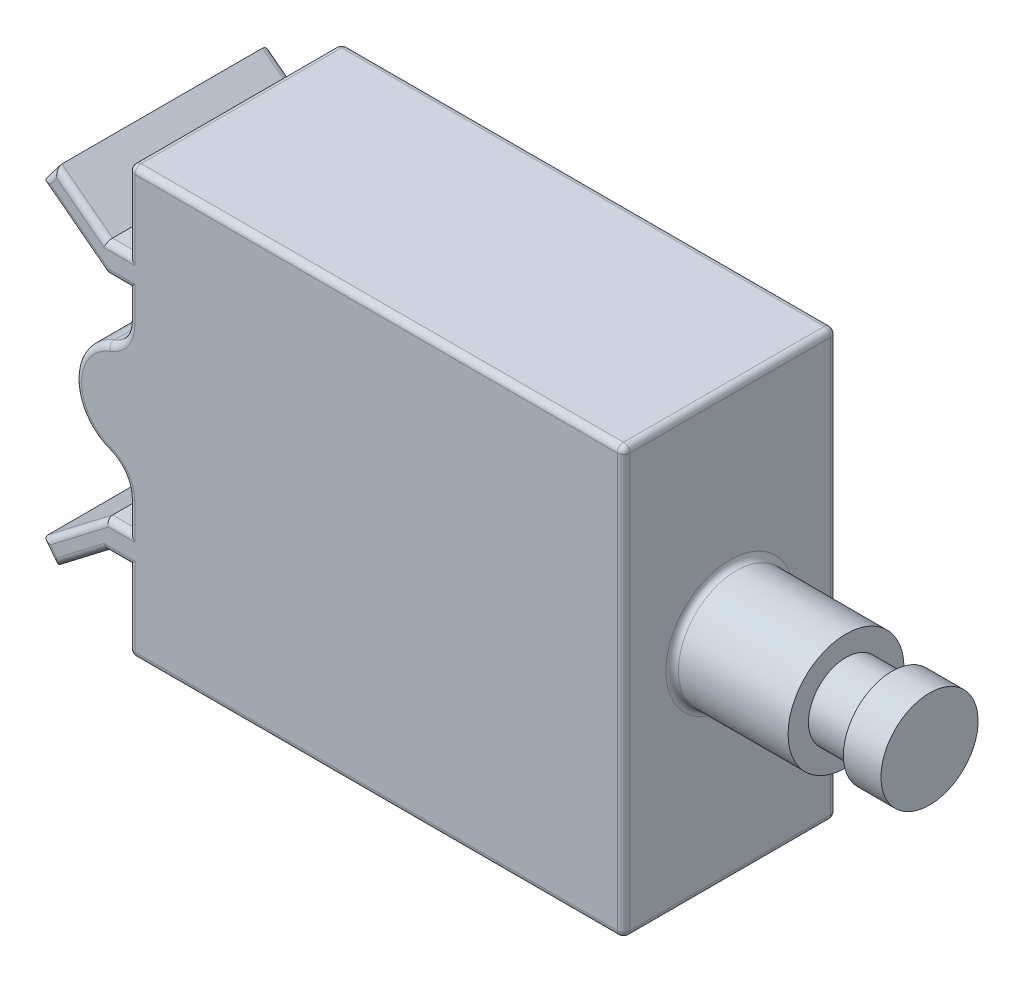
ISO-10303-21;
HEADER;
FILE_DESCRIPTION(('STEP AP214'),'2;1');
FILE_NAME('part.step','',(''),(''),'','','');
FILE_SCHEMA(('AUTOMOTIVE_DESIGN { 1 0 10303 214 1 1 1 1 }'));
ENDSEC;
DATA;
#1=APPLICATION_CONTEXT('core data for automotive mechanical design processes');
#2=APPLICATION_PROTOCOL_DEFINITION('international standard','automotive_design',2000,#1);
#3=PRODUCT_CONTEXT('',#1,'mechanical');
#4=PRODUCT('Part','Part','',(#3));
#5=PRODUCT_RELATED_PRODUCT_CATEGORY('part','',(#4));
#6=PRODUCT_DEFINITION_FORMATION('','',#4);
#7=PRODUCT_DEFINITION_CONTEXT('part definition',#1,'design');
#8=PRODUCT_DEFINITION('design','',#6,#7);
#9=PRODUCT_DEFINITION_SHAPE('','',#8);
#10=(LENGTH_UNIT() NAMED_UNIT(*) SI_UNIT(.MILLI.,.METRE.));
#11=(NAMED_UNIT(*) PLANE_ANGLE_UNIT() SI_UNIT($,.RADIAN.));
#12=(NAMED_UNIT(*) SI_UNIT($,.STERADIAN.) SOLID_ANGLE_UNIT());
#13=UNCERTAINTY_MEASURE_WITH_UNIT(LENGTH_MEASURE(1.E-05),#10,'distance_accuracy_value','');
#14=(GEOMETRIC_REPRESENTATION_CONTEXT(3) GLOBAL_UNCERTAINTY_ASSIGNED_CONTEXT((#13)) GLOBAL_UNIT_ASSIGNED_CONTEXT((#10,
#11,#12)) REPRESENTATION_CONTEXT('',''));
#15=CARTESIAN_POINT('',(0.,0.,0.));
#16=DIRECTION('',(0.,0.,1.));
#17=DIRECTION('',(1.,0.,0.));
#18=AXIS2_PLACEMENT_3D('',#15,#16,#17);
#19=CARTESIAN_POINT('',(0.,0.,17.272));
#20=DIRECTION('',(1.,0.,0.));
#21=DIRECTION('',(0.,1.,0.));
#22=AXIS2_PLACEMENT_3D('',#19,#20,#21);
#23=PLANE('',#22);
#24=DIRECTION('',(0.,0.,1.));
#25=VECTOR('',#24,1.);
#26=CARTESIAN_POINT('',(0.,11.0710697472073,0.));
#27=LINE('',#26,#25);
#28=CARTESIAN_POINT('',(0.,11.0710697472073,16.764));
#29=VERTEX_POINT('',#28);
#30=CARTESIAN_POINT('',(0.,11.0710697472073,0.508000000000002));
#31=VERTEX_POINT('',#30);
#32=EDGE_CURVE('E733',#29,#31,#27,.F.);
#33=ORIENTED_EDGE('',*,*,#32,.T.);
#34=DIRECTION('',(0.,-1.,0.));
#35=VECTOR('',#34,1.);
#36=CARTESIAN_POINT('',(0.,8.71896838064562,0.508000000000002));
#37=LINE('',#36,#35);
#38=CARTESIAN_POINT('',(0.,8.71896838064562,0.508000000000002));
#39=VERTEX_POINT('',#38);
#40=EDGE_CURVE('E494',#31,#39,#37,.T.);
#41=ORIENTED_EDGE('',*,*,#40,.T.);
#42=DIRECTION('',(0.,0.,1.));
#43=VECTOR('',#42,1.);
#44=CARTESIAN_POINT('',(0.,8.71896838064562,-8.92598721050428));
#45=LINE('',#44,#43);
#46=CARTESIAN_POINT('',(0.,8.71896838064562,16.764));
#47=VERTEX_POINT('',#46);
#48=EDGE_CURVE('E682',#39,#47,#45,.T.);
#49=ORIENTED_EDGE('',*,*,#48,.T.);
#50=DIRECTION('',(0.,-1.,0.));
#51=VECTOR('',#50,1.);
#52=CARTESIAN_POINT('',(0.,0.,16.764));
#53=LINE('',#52,#51);
#54=EDGE_CURVE('E492',#47,#29,#53,.F.);
#55=ORIENTED_EDGE('',*,*,#54,.T.);
#56=EDGE_LOOP('',(#33,#41,#49,#55));
#57=FACE_BOUND('',#56,.T.);
#58=ADVANCED_FACE('F32',(#57),#23,.F.);
#59=CARTESIAN_POINT('',(0.,21.336,17.272));
#60=DIRECTION('',(1.,0.,0.));
#61=DIRECTION('',(0.,0.,-1.));
#62=AXIS2_PLACEMENT_3D('',#59,#60,#61);
#63=PLANE('',#62);
#64=DIRECTION('',(0.,0.,-1.));
#65=VECTOR('',#64,1.);
#66=CARTESIAN_POINT('',(0.,34.036,17.272));
#67=LINE('',#66,#65);
#68=CARTESIAN_POINT('',(0.,34.036,16.764));
#69=VERTEX_POINT('',#68);
#70=CARTESIAN_POINT('',(0.,34.036,0.508000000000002));
#71=VERTEX_POINT('',#70);
#72=EDGE_CURVE('E369',#69,#71,#67,.T.);
#73=ORIENTED_EDGE('',*,*,#72,.T.);
#74=DIRECTION('',(0.,-1.,0.));
#75=VECTOR('',#74,1.);
#76=CARTESIAN_POINT('',(0.,28.1582055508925,0.508000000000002));
#77=LINE('',#76,#75);
#78=CARTESIAN_POINT('',(0.,28.1582055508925,0.508000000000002));
#79=VERTEX_POINT('',#78);
#80=EDGE_CURVE('E371',#71,#79,#77,.T.);
#81=ORIENTED_EDGE('',*,*,#80,.T.);
#82=DIRECTION('',(0.,0.,1.));
#83=VECTOR('',#82,1.);
#84=CARTESIAN_POINT('',(0.,28.1582055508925,-8.92598721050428));
#85=LINE('',#84,#83);
#86=CARTESIAN_POINT('',(0.,28.1582055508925,16.764));
#87=VERTEX_POINT('',#86);
#88=EDGE_CURVE('E704',#79,#87,#85,.T.);
#89=ORIENTED_EDGE('',*,*,#88,.T.);
#90=DIRECTION('',(0.,-1.,0.));
#91=VECTOR('',#90,1.);
#92=CARTESIAN_POINT('',(0.,21.336,16.764));
#93=LINE('',#92,#91);
#94=EDGE_CURVE('E367',#87,#69,#93,.F.);
#95=ORIENTED_EDGE('',*,*,#94,.T.);
#96=EDGE_LOOP('',(#73,#81,#89,#95));
#97=FACE_BOUND('',#96,.T.);
#98=ADVANCED_FACE('F786',(#97),#63,.F.);
#99=CARTESIAN_POINT('',(49.53,17.272,8.636));
#100=DIRECTION('',(1.,0.,0.));
#101=DIRECTION('',(0.,0.,-1.));
#102=AXIS2_PLACEMENT_3D('',#99,#100,#101);
#103=PLANE('',#102);
#104=CARTESIAN_POINT('',(49.53,17.272,8.636));
#105=DIRECTION('',(1.,0.,0.));
#106=DIRECTION('',(0.,0.,-1.));
#107=AXIS2_PLACEMENT_3D('',#104,#105,#106);
#108=CIRCLE('',#107,4.699);
#109=CARTESIAN_POINT('',(49.53,17.272,3.937));
#110=VERTEX_POINT('',#109);
#111=EDGE_CURVE('E728',#110,#110,#108,.T.);
#112=ORIENTED_EDGE('',*,*,#111,.T.);
#113=EDGE_LOOP('',(#112));
#114=FACE_BOUND('',#113,.T.);
#115=CARTESIAN_POINT('',(49.53,17.272,8.636));
#116=DIRECTION('',(1.,0.,0.));
#117=DIRECTION('',(0.,0.,-1.));
#118=AXIS2_PLACEMENT_3D('',#115,#116,#117);
#119=CIRCLE('',#118,3.048);
#120=CARTESIAN_POINT('',(49.53,17.272,11.684));
#121=VERTEX_POINT('',#120);
#122=EDGE_CURVE('E722',#121,#121,#119,.T.);
#123=ORIENTED_EDGE('',*,*,#122,.F.);
#124=EDGE_LOOP('',(#123));
#125=FACE_BOUND('',#124,.T.);
#126=ADVANCED_FACE('F792',(#114,#125),#103,.T.);
#127=CARTESIAN_POINT('',(40.132,0.,17.272));
#128=DIRECTION('',(-1.,0.,0.));
#129=DIRECTION('',(0.,0.,1.));
#130=AXIS2_PLACEMENT_3D('',#127,#128,#129);
#131=PLANE('',#130);
#132=CARTESIAN_POINT('',(40.132,17.272,8.636));
#133=DIRECTION('',(-1.,0.,0.));
#134=DIRECTION('',(0.,0.,1.));
#135=AXIS2_PLACEMENT_3D('',#132,#133,#134);
#136=CIRCLE('',#135,5.207);
#137=CARTESIAN_POINT('',(40.132,17.272,13.843));
#138=VERTEX_POINT('',#137);
#139=EDGE_CURVE('E392',#138,#138,#136,.T.);
#140=ORIENTED_EDGE('',*,*,#139,.T.);
#141=EDGE_LOOP('',(#140));
#142=FACE_BOUND('',#141,.T.);
#143=DIRECTION('',(0.,0.,-1.));
#144=VECTOR('',#143,1.);
#145=CARTESIAN_POINT('',(40.132,0.508,17.272));
#146=LINE('',#145,#144);
#147=CARTESIAN_POINT('',(40.132,0.508,16.764));
#148=VERTEX_POINT('',#147);
#149=CARTESIAN_POINT('',(40.132,0.508,0.508000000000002));
#150=VERTEX_POINT('',#149);
#151=EDGE_CURVE('E332',#148,#150,#146,.T.);
#152=ORIENTED_EDGE('',*,*,#151,.T.);
#153=DIRECTION('',(0.,1.,0.));
#154=VECTOR('',#153,1.);
#155=CARTESIAN_POINT('',(40.132,34.544,0.508000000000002));
#156=LINE('',#155,#154);
#157=CARTESIAN_POINT('',(40.132,34.036,0.508000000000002));
#158=VERTEX_POINT('',#157);
#159=EDGE_CURVE('E390',#150,#158,#156,.T.);
#160=ORIENTED_EDGE('',*,*,#159,.T.);
#161=DIRECTION('',(0.,0.,-1.));
#162=VECTOR('',#161,1.);
#163=CARTESIAN_POINT('',(40.132,34.036,17.272));
#164=LINE('',#163,#162);
#165=CARTESIAN_POINT('',(40.132,34.036,16.764));
#166=VERTEX_POINT('',#165);
#167=EDGE_CURVE('E387',#158,#166,#164,.F.);
#168=ORIENTED_EDGE('',*,*,#167,.T.);
#169=DIRECTION('',(0.,1.,0.));
#170=VECTOR('',#169,1.);
#171=CARTESIAN_POINT('',(40.132,0.,16.764));
#172=LINE('',#171,#170);
#173=EDGE_CURVE('E385',#166,#148,#172,.F.);
#174=ORIENTED_EDGE('',*,*,#173,.T.);
#175=EDGE_LOOP('',(#152,#160,#168,#174));
#176=FACE_BOUND('',#175,.T.);
#177=ADVANCED_FACE('F798',(#142,#176),#131,.F.);
#178=DIRECTION('',(0.,0.,1.));
#179=VECTOR('',#178,1.);
#180=CARTESIAN_POINT('',(0.,6.38579444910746,-8.92598721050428));
#181=LINE('',#180,#179);
#182=CARTESIAN_POINT('',(0.,6.38579444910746,0.508000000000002));
#183=VERTEX_POINT('',#182);
#184=CARTESIAN_POINT('',(0.,6.38579444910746,16.764));
#185=VERTEX_POINT('',#184);
#186=EDGE_CURVE('E696',#183,#185,#181,.T.);
#187=ORIENTED_EDGE('',*,*,#186,.F.);
#188=DIRECTION('',(0.,-1.,0.));
#189=VECTOR('',#188,1.);
#190=CARTESIAN_POINT('',(0.,0.,0.508000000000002));
#191=LINE('',#190,#189);
#192=CARTESIAN_POINT('',(0.,0.508,0.508000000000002));
#193=VERTEX_POINT('',#192);
#194=EDGE_CURVE('E365',#183,#193,#191,.T.);
#195=ORIENTED_EDGE('',*,*,#194,.T.);
#196=DIRECTION('',(0.,0.,-1.));
#197=VECTOR('',#196,1.);
#198=CARTESIAN_POINT('',(0.,0.508,17.272));
#199=LINE('',#198,#197);
#200=CARTESIAN_POINT('',(0.,0.508,16.764));
#201=VERTEX_POINT('',#200);
#202=EDGE_CURVE('E362',#193,#201,#199,.F.);
#203=ORIENTED_EDGE('',*,*,#202,.T.);
#204=DIRECTION('',(0.,-1.,0.));
#205=VECTOR('',#204,1.);
#206=CARTESIAN_POINT('',(0.,0.,16.764));
#207=LINE('',#206,#205);
#208=EDGE_CURVE('E360',#201,#185,#207,.F.);
#209=ORIENTED_EDGE('',*,*,#208,.T.);
#210=EDGE_LOOP('',(#187,#195,#203,#209));
#211=FACE_BOUND('',#210,.T.);
#212=ADVANCED_FACE('F788',(#211),#23,.F.);
#213=CARTESIAN_POINT('',(0.,0.,17.272));
#214=DIRECTION('',(0.,1.,0.));
#215=DIRECTION('',(0.,0.,1.));
#216=AXIS2_PLACEMENT_3D('',#213,#214,#215);
#217=PLANE('',#216);
#218=DIRECTION('',(0.,0.,-1.));
#219=VECTOR('',#218,1.);
#220=CARTESIAN_POINT('',(0.508,0.,17.272));
#221=LINE('',#220,#219);
#222=CARTESIAN_POINT('',(0.508,0.,16.764));
#223=VERTEX_POINT('',#222);
#224=CARTESIAN_POINT('',(0.508,0.,0.508000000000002));
#225=VERTEX_POINT('',#224);
#226=EDGE_CURVE('E324',#223,#225,#221,.T.);
#227=ORIENTED_EDGE('',*,*,#226,.T.);
#228=DIRECTION('',(1.,0.,0.));
#229=VECTOR('',#228,1.);
#230=CARTESIAN_POINT('',(40.132,0.,0.508000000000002));
#231=LINE('',#230,#229);
#232=CARTESIAN_POINT('',(39.624,0.,0.508000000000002));
#233=VERTEX_POINT('',#232);
#234=EDGE_CURVE('E320',#225,#233,#231,.T.);
#235=ORIENTED_EDGE('',*,*,#234,.T.);
#236=DIRECTION('',(0.,0.,-1.));
#237=VECTOR('',#236,1.);
#238=CARTESIAN_POINT('',(39.624,0.,17.272));
#239=LINE('',#238,#237);
#240=CARTESIAN_POINT('',(39.624,0.,16.764));
#241=VERTEX_POINT('',#240);
#242=EDGE_CURVE('E312',#233,#241,#239,.F.);
#243=ORIENTED_EDGE('',*,*,#242,.T.);
#244=DIRECTION('',(1.,0.,0.));
#245=VECTOR('',#244,1.);
#246=CARTESIAN_POINT('',(0.,0.,16.764));
#247=LINE('',#246,#245);
#248=EDGE_CURVE('E317',#241,#223,#247,.F.);
#249=ORIENTED_EDGE('',*,*,#248,.T.);
#250=EDGE_LOOP('',(#227,#235,#243,#249));
#251=FACE_BOUND('',#250,.T.);
#252=ADVANCED_FACE('F315',(#251),#217,.F.);
#253=CARTESIAN_POINT('',(0.,34.544,17.272));
#254=DIRECTION('',(0.,-1.,0.));
#255=DIRECTION('',(0.,0.,-1.));
#256=AXIS2_PLACEMENT_3D('',#253,#254,#255);
#257=PLANE('',#256);
#258=DIRECTION('',(0.,0.,-1.));
#259=VECTOR('',#258,1.);
#260=CARTESIAN_POINT('',(39.624,34.544,17.272));
#261=LINE('',#260,#259);
#262=CARTESIAN_POINT('',(39.624,34.544,16.764));
#263=VERTEX_POINT('',#262);
#264=CARTESIAN_POINT('',(39.624,34.544,0.508000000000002));
#265=VERTEX_POINT('',#264);
#266=EDGE_CURVE('E375',#263,#265,#261,.T.);
#267=ORIENTED_EDGE('',*,*,#266,.T.);
#268=DIRECTION('',(-1.,0.,0.));
#269=VECTOR('',#268,1.);
#270=CARTESIAN_POINT('',(0.,34.544,0.508000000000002));
#271=LINE('',#270,#269);
#272=CARTESIAN_POINT('',(0.508,34.544,0.508000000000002));
#273=VERTEX_POINT('',#272);
#274=EDGE_CURVE('E380',#265,#273,#271,.T.);
#275=ORIENTED_EDGE('',*,*,#274,.T.);
#276=DIRECTION('',(0.,0.,-1.));
#277=VECTOR('',#276,1.);
#278=CARTESIAN_POINT('',(0.508,34.544,17.272));
#279=LINE('',#278,#277);
#280=CARTESIAN_POINT('',(0.508,34.544,16.764));
#281=VERTEX_POINT('',#280);
#282=EDGE_CURVE('E377',#273,#281,#279,.F.);
#283=ORIENTED_EDGE('',*,*,#282,.T.);
#284=DIRECTION('',(-1.,0.,0.));
#285=VECTOR('',#284,1.);
#286=CARTESIAN_POINT('',(0.,34.544,16.764));
#287=LINE('',#286,#285);
#288=EDGE_CURVE('E373',#281,#263,#287,.F.);
#289=ORIENTED_EDGE('',*,*,#288,.T.);
#290=EDGE_LOOP('',(#267,#275,#283,#289));
#291=FACE_BOUND('',#290,.T.);
#292=ADVANCED_FACE('F804',(#291),#257,.F.);
#293=DIRECTION('',(0.,0.,1.));
#294=VECTOR('',#293,1.);
#295=CARTESIAN_POINT('',(0.,25.8250316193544,-8.92598721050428));
#296=LINE('',#295,#294);
#297=CARTESIAN_POINT('',(0.,25.8250316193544,0.508000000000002));
#298=VERTEX_POINT('',#297);
#299=CARTESIAN_POINT('',(0.,25.8250316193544,16.764));
#300=VERTEX_POINT('',#299);
#301=EDGE_CURVE('E701',#298,#300,#296,.T.);
#302=ORIENTED_EDGE('',*,*,#301,.F.);
#303=DIRECTION('',(0.,-1.,0.));
#304=VECTOR('',#303,1.);
#305=CARTESIAN_POINT('',(0.,23.4729302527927,0.508000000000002));
#306=LINE('',#305,#304);
#307=CARTESIAN_POINT('',(0.,23.4729302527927,0.508000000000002));
#308=VERTEX_POINT('',#307);
#309=EDGE_CURVE('E478',#298,#308,#306,.T.);
#310=ORIENTED_EDGE('',*,*,#309,.T.);
#311=DIRECTION('',(0.,0.,1.));
#312=VECTOR('',#311,1.);
#313=CARTESIAN_POINT('',(0.,23.4729302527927,17.272));
#314=LINE('',#313,#312);
#315=CARTESIAN_POINT('',(0.,23.4729302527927,16.764));
#316=VERTEX_POINT('',#315);
#317=EDGE_CURVE('E351',#308,#316,#314,.T.);
#318=ORIENTED_EDGE('',*,*,#317,.T.);
#319=DIRECTION('',(0.,-1.,0.));
#320=VECTOR('',#319,1.);
#321=CARTESIAN_POINT('',(0.,21.336,16.764));
#322=LINE('',#321,#320);
#323=EDGE_CURVE('E476',#316,#300,#322,.F.);
#324=ORIENTED_EDGE('',*,*,#323,.T.);
#325=EDGE_LOOP('',(#302,#310,#318,#324));
#326=FACE_BOUND('',#325,.T.);
#327=ADVANCED_FACE('F769',(#326),#63,.F.);
#328=CARTESIAN_POINT('',(-0.246529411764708,17.272,17.272));
#329=DIRECTION('',(0.,0.,-1.));
#330=DIRECTION('',(-1.,0.,0.));
#331=AXIS2_PLACEMENT_3D('',#328,#329,#330);
#332=CYLINDRICAL_SURFACE('',#331,4.0714705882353);
#333=DIRECTION('',(0.,0.,-1.));
#334=VECTOR('',#333,1.);
#335=CARTESIAN_POINT('',(-1.65889265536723,21.0906519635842,17.272));
#336=LINE('',#335,#334);
#337=CARTESIAN_POINT('',(-1.65889265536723,21.0906519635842,16.764));
#338=VERTEX_POINT('',#337);
#339=CARTESIAN_POINT('',(-1.65889265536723,21.0906519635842,0.508000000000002));
#340=VERTEX_POINT('',#339);
#341=EDGE_CURVE('E736',#338,#340,#336,.T.);
#342=ORIENTED_EDGE('',*,*,#341,.T.);
#343=CARTESIAN_POINT('',(-0.246529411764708,17.272,0.508000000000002));
#344=DIRECTION('',(0.,0.,-1.));
#345=DIRECTION('',(-1.,0.,0.));
#346=AXIS2_PLACEMENT_3D('',#343,#344,#345);
#347=CIRCLE('',#346,4.0714705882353);
#348=CARTESIAN_POINT('',(-1.65889265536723,13.4533480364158,0.508000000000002));
#349=VERTEX_POINT('',#348);
#350=EDGE_CURVE('E486',#340,#349,#347,.F.);
#351=ORIENTED_EDGE('',*,*,#350,.T.);
#352=DIRECTION('',(0.,0.,-1.));
#353=VECTOR('',#352,1.);
#354=CARTESIAN_POINT('',(-1.65889265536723,13.4533480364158,17.272));
#355=LINE('',#354,#353);
#356=CARTESIAN_POINT('',(-1.65889265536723,13.4533480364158,16.764));
#357=VERTEX_POINT('',#356);
#358=EDGE_CURVE('E354',#349,#357,#355,.F.);
#359=ORIENTED_EDGE('',*,*,#358,.T.);
#360=CARTESIAN_POINT('',(-0.246529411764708,17.272,16.764));
#361=DIRECTION('',(0.,0.,-1.));
#362=DIRECTION('',(-1.,0.,0.));
#363=AXIS2_PLACEMENT_3D('',#360,#361,#362);
#364=CIRCLE('',#363,4.0714705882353);
#365=EDGE_CURVE('E484',#357,#338,#364,.T.);
#366=ORIENTED_EDGE('',*,*,#365,.T.);
#367=EDGE_LOOP('',(#342,#351,#359,#366));
#368=FACE_BOUND('',#367,.T.);
#369=ADVANCED_FACE('F742',(#368),#332,.T.);
#370=CARTESIAN_POINT('',(-0.246529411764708,17.272,17.272));
#371=DIRECTION('',(0.,0.,-1.));
#372=DIRECTION('',(-1.,0.,0.));
#373=AXIS2_PLACEMENT_3D('',#370,#371,#372);
#374=PLANE('',#373);
#375=DIRECTION('',(0.,-1.,0.));
#376=VECTOR('',#375,1.);
#377=CARTESIAN_POINT('',(0.508,17.272,17.272));
#378=LINE('',#377,#376);
#379=CARTESIAN_POINT('',(0.508,26.3330316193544,17.272));
#380=VERTEX_POINT('',#379);
#381=CARTESIAN_POINT('',(0.508,23.4729302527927,17.272));
#382=VERTEX_POINT('',#381);
#383=EDGE_CURVE('E41',#380,#382,#378,.T.);
#384=ORIENTED_EDGE('',*,*,#383,.T.);
#385=CARTESIAN_POINT('',(-2.54,23.4729302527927,17.272));
#386=DIRECTION('',(0.,0.,-1.));
#387=DIRECTION('',(-1.,0.,0.));
#388=AXIS2_PLACEMENT_3D('',#385,#386,#387);
#389=CIRCLE('',#388,3.048);
#390=CARTESIAN_POINT('',(-1.48267118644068,20.6141963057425,17.272));
#391=VERTEX_POINT('',#390);
#392=EDGE_CURVE('E11',#382,#391,#389,.T.);
#393=ORIENTED_EDGE('',*,*,#392,.T.);
#394=CARTESIAN_POINT('',(-0.246529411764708,17.272,17.272));
#395=DIRECTION('',(0.,0.,-1.));
#396=DIRECTION('',(-1.,0.,0.));
#397=AXIS2_PLACEMENT_3D('',#394,#395,#396);
#398=CIRCLE('',#397,3.5634705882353);
#399=CARTESIAN_POINT('',(-1.48267118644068,13.9298036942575,17.272));
#400=VERTEX_POINT('',#399);
#401=EDGE_CURVE('E496',#391,#400,#398,.F.);
#402=ORIENTED_EDGE('',*,*,#401,.T.);
#403=CARTESIAN_POINT('',(-2.54,11.0710697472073,17.272));
#404=DIRECTION('',(0.,0.,-1.));
#405=DIRECTION('',(-1.,0.,0.));
#406=AXIS2_PLACEMENT_3D('',#403,#404,#405);
#407=CIRCLE('',#406,3.048);
#408=CARTESIAN_POINT('',(0.508000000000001,11.0710697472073,17.272));
#409=VERTEX_POINT('',#408);
#410=EDGE_CURVE('E498',#400,#409,#407,.T.);
#411=ORIENTED_EDGE('',*,*,#410,.T.);
#412=DIRECTION('',(0.,-1.,0.));
#413=VECTOR('',#412,1.);
#414=CARTESIAN_POINT('',(0.508000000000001,17.272,17.272));
#415=LINE('',#414,#413);
#416=CARTESIAN_POINT('',(0.508000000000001,8.21096838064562,17.272));
#417=VERTEX_POINT('',#416);
#418=EDGE_CURVE('E500',#409,#417,#415,.T.);
#419=ORIENTED_EDGE('',*,*,#418,.T.);
#420=DIRECTION('',(-1.,0.,0.));
#421=VECTOR('',#420,1.);
#422=CARTESIAN_POINT('',(-1.8059906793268,8.21096838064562,17.272));
#423=LINE('',#422,#421);
#424=CARTESIAN_POINT('',(-1.63366567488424,8.21096838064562,17.272));
#425=VERTEX_POINT('',#424);
#426=EDGE_CURVE('E502',#417,#425,#423,.T.);
#427=ORIENTED_EDGE('',*,*,#426,.T.);
#428=DIRECTION('',(-0.793606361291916,-0.608431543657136,0.));
#429=VECTOR('',#428,1.);
#430=CARTESIAN_POINT('',(-6.73345742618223,4.30112803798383,17.272));
#431=LINE('',#430,#429);
#432=CARTESIAN_POINT('',(-6.33030539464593,4.61021126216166,17.272));
#433=VERTEX_POINT('',#432);
#434=EDGE_CURVE('E504',#425,#433,#431,.T.);
#435=ORIENTED_EDGE('',*,*,#434,.T.);
#436=DIRECTION('',(0.608431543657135,-0.793606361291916,0.));
#437=VECTOR('',#436,1.);
#438=CARTESIAN_POINT('',(-5.51280358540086,3.54390455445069,17.272));
#439=LINE('',#438,#437);
#440=CARTESIAN_POINT('',(-5.82188680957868,3.94705658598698,17.272));
#441=VERTEX_POINT('',#440);
#442=EDGE_CURVE('E506',#433,#441,#439,.T.);
#443=ORIENTED_EDGE('',*,*,#442,.T.);
#444=DIRECTION('',(0.793606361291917,0.608431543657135,0.));
#445=VECTOR('',#444,1.);
#446=CARTESIAN_POINT('',(-2.11507390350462,6.78894648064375,17.272));
#447=LINE('',#446,#445);
#448=CARTESIAN_POINT('',(-1.97831568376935,6.89379444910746,17.272));
#449=VERTEX_POINT('',#448);
#450=EDGE_CURVE('E508',#441,#449,#447,.T.);
#451=ORIENTED_EDGE('',*,*,#450,.T.);
#452=DIRECTION('',(1.,0.,0.));
#453=VECTOR('',#452,1.);
#454=CARTESIAN_POINT('',(0.,6.89379444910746,17.272));
#455=LINE('',#454,#453);
#456=CARTESIAN_POINT('',(0.508000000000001,6.89379444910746,17.272));
#457=VERTEX_POINT('',#456);
#458=EDGE_CURVE('E510',#449,#457,#455,.T.);
#459=ORIENTED_EDGE('',*,*,#458,.T.);
#460=DIRECTION('',(0.,-1.,0.));
#461=VECTOR('',#460,1.);
#462=CARTESIAN_POINT('',(0.508000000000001,17.272,17.272));
#463=LINE('',#462,#461);
#464=CARTESIAN_POINT('',(0.508,0.508000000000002,17.272));
#465=VERTEX_POINT('',#464);
#466=EDGE_CURVE('E512',#457,#465,#463,.T.);
#467=ORIENTED_EDGE('',*,*,#466,.T.);
#468=DIRECTION('',(1.,0.,0.));
#469=VECTOR('',#468,1.);
#470=CARTESIAN_POINT('',(-0.246529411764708,0.508000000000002,17.272));
#471=LINE('',#470,#469);
#472=CARTESIAN_POINT('',(39.624,0.508000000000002,17.272));
#473=VERTEX_POINT('',#472);
#474=EDGE_CURVE('E514',#465,#473,#471,.T.);
#475=ORIENTED_EDGE('',*,*,#474,.T.);
#476=DIRECTION('',(0.,1.,0.));
#477=VECTOR('',#476,1.);
#478=CARTESIAN_POINT('',(39.624,17.272,17.272));
#479=LINE('',#478,#477);
#480=CARTESIAN_POINT('',(39.624,34.036,17.272));
#481=VERTEX_POINT('',#480);
#482=EDGE_CURVE('E516',#473,#481,#479,.T.);
#483=ORIENTED_EDGE('',*,*,#482,.T.);
#484=DIRECTION('',(-1.,0.,0.));
#485=VECTOR('',#484,1.);
#486=CARTESIAN_POINT('',(-0.246529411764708,34.036,17.272));
#487=LINE('',#486,#485);
#488=CARTESIAN_POINT('',(0.508,34.036,17.272));
#489=VERTEX_POINT('',#488);
#490=EDGE_CURVE('E518',#481,#489,#487,.T.);
#491=ORIENTED_EDGE('',*,*,#490,.T.);
#492=DIRECTION('',(0.,-1.,0.));
#493=VECTOR('',#492,1.);
#494=CARTESIAN_POINT('',(0.508,17.272,17.272));
#495=LINE('',#494,#493);
#496=CARTESIAN_POINT('',(0.508,27.6502055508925,17.272));
#497=VERTEX_POINT('',#496);
#498=EDGE_CURVE('E520',#489,#497,#495,.T.);
#499=ORIENTED_EDGE('',*,*,#498,.T.);
#500=DIRECTION('',(-1.,0.,0.));
#501=VECTOR('',#500,1.);
#502=CARTESIAN_POINT('',(-1.8059906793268,27.6502055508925,17.272));
#503=LINE('',#502,#501);
#504=CARTESIAN_POINT('',(-1.97831568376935,27.6502055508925,17.272));
#505=VERTEX_POINT('',#504);
#506=EDGE_CURVE('E522',#497,#505,#503,.T.);
#507=ORIENTED_EDGE('',*,*,#506,.T.);
#508=DIRECTION('',(-0.793606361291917,0.608431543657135,0.));
#509=VECTOR('',#508,1.);
#510=CARTESIAN_POINT('',(-6.22503884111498,30.9060266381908,17.272));
#511=LINE('',#510,#509);
#512=CARTESIAN_POINT('',(-5.82188680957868,30.596943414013,17.272));
#513=VERTEX_POINT('',#512);
#514=EDGE_CURVE('E524',#505,#513,#511,.T.);
#515=ORIENTED_EDGE('',*,*,#514,.T.);
#516=DIRECTION('',(-0.608431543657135,-0.793606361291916,0.));
#517=VECTOR('',#516,1.);
#518=CARTESIAN_POINT('',(-6.63938861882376,29.5306367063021,17.272));
#519=LINE('',#518,#517);
#520=CARTESIAN_POINT('',(-6.33030539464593,29.9337887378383,17.272));
#521=VERTEX_POINT('',#520);
#522=EDGE_CURVE('E526',#513,#521,#519,.T.);
#523=ORIENTED_EDGE('',*,*,#522,.T.);
#524=DIRECTION('',(0.793606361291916,-0.608431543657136,0.));
#525=VECTOR('',#524,1.);
#526=CARTESIAN_POINT('',(-1.49690745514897,26.2281836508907,17.272));
#527=LINE('',#526,#525);
#528=CARTESIAN_POINT('',(-1.63366567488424,26.3330316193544,17.272));
#529=VERTEX_POINT('',#528);
#530=EDGE_CURVE('E528',#521,#529,#527,.T.);
#531=ORIENTED_EDGE('',*,*,#530,.T.);
#532=DIRECTION('',(1.,0.,0.));
#533=VECTOR('',#532,1.);
#534=CARTESIAN_POINT('',(0.,26.3330316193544,17.272));
#535=LINE('',#534,#533);
#536=EDGE_CURVE('E52',#529,#380,#535,.T.);
#537=ORIENTED_EDGE('',*,*,#536,.T.);
#538=EDGE_LOOP('',(#384,#393,#402,#411,#419,#427,#435,#443,#451,#459,#467,#475,#483,#491,#499,
#507,#515,#523,#531,#537));
#539=FACE_BOUND('',#538,.T.);
#540=ADVANCED_FACE('F757',(#539),#374,.F.);
#541=CARTESIAN_POINT('',(-0.246529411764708,17.272,0.));
#542=DIRECTION('',(0.,0.,-1.));
#543=DIRECTION('',(-1.,0.,0.));
#544=AXIS2_PLACEMENT_3D('',#541,#542,#543);
#545=PLANE('',#544);
#546=DIRECTION('',(-0.793606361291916,-0.608431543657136,0.));
#547=VECTOR('',#546,1.);
#548=CARTESIAN_POINT('',(3.61513380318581,12.2350479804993,0.));
#549=LINE('',#548,#547);
#550=CARTESIAN_POINT('',(-6.33030539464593,4.61021126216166,0.));
#551=VERTEX_POINT('',#550);
#552=CARTESIAN_POINT('',(-1.63366567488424,8.21096838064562,0.));
#553=VERTEX_POINT('',#552);
#554=EDGE_CURVE('E435',#551,#553,#549,.F.);
#555=ORIENTED_EDGE('',*,*,#554,.T.);
#556=DIRECTION('',(-1.,0.,0.));
#557=VECTOR('',#556,1.);
#558=CARTESIAN_POINT('',(-0.246529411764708,8.21096838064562,0.));
#559=LINE('',#558,#557);
#560=CARTESIAN_POINT('',(0.508000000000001,8.21096838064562,0.));
#561=VERTEX_POINT('',#560);
#562=EDGE_CURVE('E437',#553,#561,#559,.F.);
#563=ORIENTED_EDGE('',*,*,#562,.T.);
#564=DIRECTION('',(0.,-1.,0.));
#565=VECTOR('',#564,1.);
#566=CARTESIAN_POINT('',(0.508000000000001,11.0710697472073,0.));
#567=LINE('',#566,#565);
#568=CARTESIAN_POINT('',(0.508000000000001,11.0710697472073,0.));
#569=VERTEX_POINT('',#568);
#570=EDGE_CURVE('E399',#561,#569,#567,.F.);
#571=ORIENTED_EDGE('',*,*,#570,.T.);
#572=CARTESIAN_POINT('',(-2.54,11.0710697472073,0.));
#573=DIRECTION('',(0.,0.,-1.));
#574=DIRECTION('',(-1.,0.,0.));
#575=AXIS2_PLACEMENT_3D('',#572,#573,#574);
#576=CIRCLE('',#575,3.048);
#577=CARTESIAN_POINT('',(-1.48267118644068,13.9298036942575,0.));
#578=VERTEX_POINT('',#577);
#579=EDGE_CURVE('E401',#569,#578,#576,.F.);
#580=ORIENTED_EDGE('',*,*,#579,.T.);
#581=CARTESIAN_POINT('',(-0.246529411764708,17.272,0.));
#582=DIRECTION('',(0.,0.,-1.));
#583=DIRECTION('',(-1.,0.,0.));
#584=AXIS2_PLACEMENT_3D('',#581,#582,#583);
#585=CIRCLE('',#584,3.5634705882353);
#586=CARTESIAN_POINT('',(-1.48267118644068,20.6141963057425,0.));
#587=VERTEX_POINT('',#586);
#588=EDGE_CURVE('E403',#578,#587,#585,.T.);
#589=ORIENTED_EDGE('',*,*,#588,.T.);
#590=CARTESIAN_POINT('',(-2.54,23.4729302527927,0.));
#591=DIRECTION('',(0.,0.,-1.));
#592=DIRECTION('',(-1.,0.,0.));
#593=AXIS2_PLACEMENT_3D('',#590,#591,#592);
#594=CIRCLE('',#593,3.048);
#595=CARTESIAN_POINT('',(0.508,23.4729302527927,0.));
#596=VERTEX_POINT('',#595);
#597=EDGE_CURVE('E405',#587,#596,#594,.F.);
#598=ORIENTED_EDGE('',*,*,#597,.T.);
#599=DIRECTION('',(0.,-1.,0.));
#600=VECTOR('',#599,1.);
#601=CARTESIAN_POINT('',(0.508,25.8250316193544,0.));
#602=LINE('',#601,#600);
#603=CARTESIAN_POINT('',(0.508,26.3330316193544,0.));
#604=VERTEX_POINT('',#603);
#605=EDGE_CURVE('E407',#596,#604,#602,.F.);
#606=ORIENTED_EDGE('',*,*,#605,.T.);
#607=DIRECTION('',(1.,0.,0.));
#608=VECTOR('',#607,1.);
#609=CARTESIAN_POINT('',(-0.246529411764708,26.3330316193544,0.));
#610=LINE('',#609,#608);
#611=CARTESIAN_POINT('',(-1.63366567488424,26.3330316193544,0.));
#612=VERTEX_POINT('',#611);
#613=EDGE_CURVE('E409',#604,#612,#610,.F.);
#614=ORIENTED_EDGE('',*,*,#613,.T.);
#615=DIRECTION('',(0.793606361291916,-0.608431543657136,0.));
#616=VECTOR('',#615,1.);
#617=CARTESIAN_POINT('',(3.61513380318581,22.3089520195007,0.));
#618=LINE('',#617,#616);
#619=CARTESIAN_POINT('',(-6.33030539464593,29.9337887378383,0.));
#620=VERTEX_POINT('',#619);
#621=EDGE_CURVE('E411',#612,#620,#618,.F.);
#622=ORIENTED_EDGE('',*,*,#621,.T.);
#623=DIRECTION('',(-0.608431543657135,-0.793606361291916,0.));
#624=VECTOR('',#623,1.);
#625=CARTESIAN_POINT('',(-10.1919686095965,24.8968367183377,0.));
#626=LINE('',#625,#624);
#627=CARTESIAN_POINT('',(-5.82188680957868,30.596943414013,0.));
#628=VERTEX_POINT('',#627);
#629=EDGE_CURVE('E413',#620,#628,#626,.F.);
#630=ORIENTED_EDGE('',*,*,#629,.T.);
#631=DIRECTION('',(-0.793606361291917,0.608431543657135,0.));
#632=VECTOR('',#631,1.);
#633=CARTESIAN_POINT('',(4.12355238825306,22.9721066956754,0.));
#634=LINE('',#633,#632);
#635=CARTESIAN_POINT('',(-1.97831568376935,27.6502055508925,0.));
#636=VERTEX_POINT('',#635);
#637=EDGE_CURVE('E415',#628,#636,#634,.F.);
#638=ORIENTED_EDGE('',*,*,#637,.T.);
#639=DIRECTION('',(-1.,0.,0.));
#640=VECTOR('',#639,1.);
#641=CARTESIAN_POINT('',(-0.246529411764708,27.6502055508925,0.));
#642=LINE('',#641,#640);
#643=CARTESIAN_POINT('',(0.508,27.6502055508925,0.));
#644=VERTEX_POINT('',#643);
#645=EDGE_CURVE('E417',#636,#644,#642,.F.);
#646=ORIENTED_EDGE('',*,*,#645,.T.);
#647=DIRECTION('',(0.,-1.,0.));
#648=VECTOR('',#647,1.);
#649=CARTESIAN_POINT('',(0.508,34.544,0.));
#650=LINE('',#649,#648);
#651=CARTESIAN_POINT('',(0.508,34.036,0.));
#652=VERTEX_POINT('',#651);
#653=EDGE_CURVE('E419',#644,#652,#650,.F.);
#654=ORIENTED_EDGE('',*,*,#653,.T.);
#655=DIRECTION('',(-1.,0.,0.));
#656=VECTOR('',#655,1.);
#657=CARTESIAN_POINT('',(40.132,34.036,0.));
#658=LINE('',#657,#656);
#659=CARTESIAN_POINT('',(39.624,34.036,0.));
#660=VERTEX_POINT('',#659);
#661=EDGE_CURVE('E421',#652,#660,#658,.F.);
#662=ORIENTED_EDGE('',*,*,#661,.T.);
#663=DIRECTION('',(0.,1.,0.));
#664=VECTOR('',#663,1.);
#665=CARTESIAN_POINT('',(39.624,0.,0.));
#666=LINE('',#665,#664);
#667=CARTESIAN_POINT('',(39.624,0.508,0.));
#668=VERTEX_POINT('',#667);
#669=EDGE_CURVE('E423',#660,#668,#666,.F.);
#670=ORIENTED_EDGE('',*,*,#669,.T.);
#671=DIRECTION('',(1.,0.,0.));
#672=VECTOR('',#671,1.);
#673=CARTESIAN_POINT('',(0.,0.508,0.));
#674=LINE('',#673,#672);
#675=CARTESIAN_POINT('',(0.508,0.508,0.));
#676=VERTEX_POINT('',#675);
#677=EDGE_CURVE('E425',#668,#676,#674,.F.);
#678=ORIENTED_EDGE('',*,*,#677,.T.);
#679=DIRECTION('',(0.,-1.,0.));
#680=VECTOR('',#679,1.);
#681=CARTESIAN_POINT('',(0.508,6.38579444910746,0.));
#682=LINE('',#681,#680);
#683=CARTESIAN_POINT('',(0.508,6.89379444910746,0.));
#684=VERTEX_POINT('',#683);
#685=EDGE_CURVE('E427',#676,#684,#682,.F.);
#686=ORIENTED_EDGE('',*,*,#685,.T.);
#687=DIRECTION('',(1.,0.,0.));
#688=VECTOR('',#687,1.);
#689=CARTESIAN_POINT('',(-0.246529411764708,6.89379444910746,0.));
#690=LINE('',#689,#688);
#691=CARTESIAN_POINT('',(-1.97831568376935,6.89379444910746,0.));
#692=VERTEX_POINT('',#691);
#693=EDGE_CURVE('E429',#684,#692,#690,.F.);
#694=ORIENTED_EDGE('',*,*,#693,.T.);
#695=DIRECTION('',(0.793606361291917,0.608431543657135,0.));
#696=VECTOR('',#695,1.);
#697=CARTESIAN_POINT('',(4.12355238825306,11.5718933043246,0.));
#698=LINE('',#697,#696);
#699=CARTESIAN_POINT('',(-5.82188680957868,3.94705658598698,0.));
#700=VERTEX_POINT('',#699);
#701=EDGE_CURVE('E431',#692,#700,#698,.F.);
#702=ORIENTED_EDGE('',*,*,#701,.T.);
#703=DIRECTION('',(0.608431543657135,-0.793606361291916,0.));
#704=VECTOR('',#703,1.);
#705=CARTESIAN_POINT('',(-10.1919686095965,9.64716328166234,0.));
#706=LINE('',#705,#704);
#707=EDGE_CURVE('E433',#700,#551,#706,.F.);
#708=ORIENTED_EDGE('',*,*,#707,.T.);
#709=EDGE_LOOP('',(#555,#563,#571,#580,#589,#598,#606,#614,#622,#630,#638,#646,#654,#662,#670,
#678,#686,#694,#702,#708));
#710=FACE_BOUND('',#709,.T.);
#711=ADVANCED_FACE('F920',(#710),#545,.T.);
#712=CARTESIAN_POINT('',(-2.54,11.0710697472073,17.272));
#713=DIRECTION('',(0.,0.,-1.));
#714=DIRECTION('',(-1.,0.,0.));
#715=AXIS2_PLACEMENT_3D('',#712,#713,#714);
#716=CYLINDRICAL_SURFACE('',#715,2.54);
#717=ORIENTED_EDGE('',*,*,#358,.F.);
#718=CARTESIAN_POINT('',(-2.54,11.0710697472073,0.508000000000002));
#719=DIRECTION('',(0.,0.,-1.));
#720=DIRECTION('',(-1.,0.,0.));
#721=AXIS2_PLACEMENT_3D('',#718,#719,#720);
#722=CIRCLE('',#721,2.54);
#723=EDGE_CURVE('E490',#349,#31,#722,.T.);
#724=ORIENTED_EDGE('',*,*,#723,.T.);
#725=ORIENTED_EDGE('',*,*,#32,.F.);
#726=CARTESIAN_POINT('',(-2.54,11.0710697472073,16.764));
#727=DIRECTION('',(0.,0.,-1.));
#728=DIRECTION('',(-1.,0.,0.));
#729=AXIS2_PLACEMENT_3D('',#726,#727,#728);
#730=CIRCLE('',#729,2.54);
#731=EDGE_CURVE('E488',#29,#357,#730,.F.);
#732=ORIENTED_EDGE('',*,*,#731,.T.);
#733=EDGE_LOOP('',(#717,#724,#725,#732));
#734=FACE_BOUND('',#733,.T.);
#735=ADVANCED_FACE('F942',(#734),#716,.F.);
#736=CARTESIAN_POINT('',(-2.54,23.4729302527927,17.272));
#737=DIRECTION('',(0.,0.,-1.));
#738=DIRECTION('',(-1.,0.,0.));
#739=AXIS2_PLACEMENT_3D('',#736,#737,#738);
#740=CYLINDRICAL_SURFACE('',#739,2.54);
#741=ORIENTED_EDGE('',*,*,#317,.F.);
#742=CARTESIAN_POINT('',(-2.54,23.4729302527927,0.508000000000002));
#743=DIRECTION('',(0.,0.,-1.));
#744=DIRECTION('',(-1.,0.,0.));
#745=AXIS2_PLACEMENT_3D('',#742,#743,#744);
#746=CIRCLE('',#745,2.54);
#747=EDGE_CURVE('E482',#308,#340,#746,.T.);
#748=ORIENTED_EDGE('',*,*,#747,.T.);
#749=ORIENTED_EDGE('',*,*,#341,.F.);
#750=CARTESIAN_POINT('',(-2.54,23.4729302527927,16.764));
#751=DIRECTION('',(0.,0.,-1.));
#752=DIRECTION('',(-1.,0.,0.));
#753=AXIS2_PLACEMENT_3D('',#750,#751,#752);
#754=CIRCLE('',#753,2.54);
#755=EDGE_CURVE('E480',#338,#316,#754,.F.);
#756=ORIENTED_EDGE('',*,*,#755,.T.);
#757=EDGE_LOOP('',(#741,#748,#749,#756));
#758=FACE_BOUND('',#757,.T.);
#759=ADVANCED_FACE('F765',(#758),#740,.F.);
#760=CARTESIAN_POINT('',(49.53,17.272,8.636));
#761=DIRECTION('',(-1.,0.,0.));
#762=DIRECTION('',(0.,0.,1.));
#763=AXIS2_PLACEMENT_3D('',#760,#761,#762);
#764=CYLINDRICAL_SURFACE('',#763,4.699);
#765=CARTESIAN_POINT('',(40.64,17.272,8.636));
#766=DIRECTION('',(-1.,0.,0.));
#767=DIRECTION('',(0.,0.,1.));
#768=AXIS2_PLACEMENT_3D('',#765,#766,#767);
#769=CIRCLE('',#768,4.699);
#770=CARTESIAN_POINT('',(40.64,17.272,13.335));
#771=VERTEX_POINT('',#770);
#772=EDGE_CURVE('E382',#771,#771,#769,.F.);
#773=ORIENTED_EDGE('',*,*,#772,.T.);
#774=EDGE_LOOP('',(#773));
#775=FACE_BOUND('',#774,.T.);
#776=ORIENTED_EDGE('',*,*,#111,.F.);
#777=EDGE_LOOP('',(#776));
#778=FACE_BOUND('',#777,.T.);
#779=ADVANCED_FACE('F1303',(#775,#778),#764,.T.);
#780=CARTESIAN_POINT('',(53.34,17.272,8.636));
#781=DIRECTION('',(-1.,0.,0.));
#782=DIRECTION('',(0.,0.,1.));
#783=AXIS2_PLACEMENT_3D('',#780,#781,#782);
#784=CYLINDRICAL_SURFACE('',#783,3.048);
#785=CARTESIAN_POINT('',(53.34,17.272,8.636));
#786=DIRECTION('',(1.,0.,0.));
#787=DIRECTION('',(0.,0.,-1.));
#788=AXIS2_PLACEMENT_3D('',#785,#786,#787);
#789=CIRCLE('',#788,3.048);
#790=CARTESIAN_POINT('',(53.34,17.272,11.684));
#791=VERTEX_POINT('',#790);
#792=EDGE_CURVE('E725',#791,#791,#789,.T.);
#793=CARTESIAN_POINT('',(53.34,17.272,11.684));
#794=CARTESIAN_POINT('',(53.3003125,17.272,11.684));
#795=CARTESIAN_POINT('',(53.260625,17.272,11.684));
#796=CARTESIAN_POINT('',(53.18125,17.272,11.684));
#797=CARTESIAN_POINT('',(53.1415625,17.272,11.684));
#798=CARTESIAN_POINT('',(53.0621875,17.272,11.684));
#799=CARTESIAN_POINT('',(53.0225,17.272,11.684));
#800=CARTESIAN_POINT('',(52.943125,17.272,11.684));
#801=CARTESIAN_POINT('',(52.9034375,17.272,11.684));
#802=CARTESIAN_POINT('',(52.8240625,17.272,11.684));
#803=CARTESIAN_POINT('',(52.784375,17.272,11.684));
#804=CARTESIAN_POINT('',(52.705,17.272,11.684));
#805=CARTESIAN_POINT('',(52.6653125,17.272,11.684));
#806=CARTESIAN_POINT('',(52.5859375,17.272,11.684));
#807=CARTESIAN_POINT('',(52.54625,17.272,11.684));
#808=CARTESIAN_POINT('',(52.466875,17.272,11.684));
#809=CARTESIAN_POINT('',(52.4271875,17.272,11.684));
#810=CARTESIAN_POINT('',(52.3478125,17.272,11.684));
#811=CARTESIAN_POINT('',(52.308125,17.272,11.684));
#812=CARTESIAN_POINT('',(52.22875,17.272,11.684));
#813=CARTESIAN_POINT('',(52.1890625,17.272,11.684));
#814=CARTESIAN_POINT('',(52.1096875,17.272,11.684));
#815=CARTESIAN_POINT('',(52.07,17.272,11.684));
#816=CARTESIAN_POINT('',(51.990625,17.272,11.684));
#817=CARTESIAN_POINT('',(51.9509375,17.272,11.684));
#818=CARTESIAN_POINT('',(51.8715625,17.272,11.684));
#819=CARTESIAN_POINT('',(51.831875,17.272,11.684));
#820=CARTESIAN_POINT('',(51.7525,17.272,11.684));
#821=CARTESIAN_POINT('',(51.7128125,17.272,11.684));
#822=CARTESIAN_POINT('',(51.6334375,17.272,11.684));
#823=CARTESIAN_POINT('',(51.59375,17.272,11.684));
#824=CARTESIAN_POINT('',(51.514375,17.272,11.684));
#825=CARTESIAN_POINT('',(51.4746875,17.272,11.684));
#826=CARTESIAN_POINT('',(51.3953125,17.272,11.684));
#827=CARTESIAN_POINT('',(51.355625,17.272,11.684));
#828=CARTESIAN_POINT('',(51.27625,17.272,11.684));
#829=CARTESIAN_POINT('',(51.2365625,17.272,11.684));
#830=CARTESIAN_POINT('',(51.1571875,17.272,11.684));
#831=CARTESIAN_POINT('',(51.1175,17.272,11.684));
#832=CARTESIAN_POINT('',(51.038125,17.272,11.684));
#833=CARTESIAN_POINT('',(50.9984375,17.272,11.684));
#834=CARTESIAN_POINT('',(50.9190625,17.272,11.684));
#835=CARTESIAN_POINT('',(50.879375,17.272,11.684));
#836=CARTESIAN_POINT('',(50.8,17.272,11.684));
#837=CARTESIAN_POINT('',(50.7603125,17.272,11.684));
#838=CARTESIAN_POINT('',(50.6809375,17.272,11.684));
#839=CARTESIAN_POINT('',(50.64125,17.272,11.684));
#840=CARTESIAN_POINT('',(50.561875,17.272,11.684));
#841=CARTESIAN_POINT('',(50.5221875,17.272,11.684));
#842=CARTESIAN_POINT('',(50.4428125,17.272,11.684));
#843=CARTESIAN_POINT('',(50.403125,17.272,11.684));
#844=CARTESIAN_POINT('',(50.32375,17.272,11.684));
#845=CARTESIAN_POINT('',(50.2840625,17.272,11.684));
#846=CARTESIAN_POINT('',(50.2046875,17.272,11.684));
#847=CARTESIAN_POINT('',(50.165,17.272,11.684));
#848=CARTESIAN_POINT('',(50.085625,17.272,11.684));
#849=CARTESIAN_POINT('',(50.0459375,17.272,11.684));
#850=CARTESIAN_POINT('',(49.9665625,17.272,11.684));
#851=CARTESIAN_POINT('',(49.926875,17.272,11.684));
#852=CARTESIAN_POINT('',(49.8475,17.272,11.684));
#853=CARTESIAN_POINT('',(49.8078125,17.272,11.684));
#854=CARTESIAN_POINT('',(49.7284375,17.272,11.684));
#855=CARTESIAN_POINT('',(49.68875,17.272,11.684));
#856=CARTESIAN_POINT('',(49.609375,17.272,11.684));
#857=CARTESIAN_POINT('',(49.5696875,17.272,11.684));
#858=CARTESIAN_POINT('',(49.53,17.272,11.684));
#859=B_SPLINE_CURVE_WITH_KNOTS('',3,(#793,#794,#795,#796,#797,#798,#799,#800,#801,#802,#803,
#804,#805,#806,#807,#808,#809,#810,#811,#812,#813,#814,#815,#816,#817,#818,#819,#820,#821,#822,
#823,#824,#825,#826,#827,#828,#829,#830,#831,#832,#833,#834,#835,#836,#837,#838,#839,#840,#841,
#842,#843,#844,#845,#846,#847,#848,#849,#850,#851,#852,#853,#854,#855,#856,#857,#858),
.UNSPECIFIED.,.F.,.F.,(4,2,2,2,2,2,2,2,2,2,2,2,2,2,2,2,2,2,2,2,2,2,2,2,2,2,2,2,2,2,2,2,4),(0.,
0.119062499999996,0.238124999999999,0.357187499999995,0.476249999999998,0.595312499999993,
0.714374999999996,0.833437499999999,0.952499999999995,1.0715625,1.19062499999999,1.3096875,
1.42875,1.5478125,1.666875,1.78593749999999,1.905,2.0240625,2.143125,2.2621875,2.38124999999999,
2.5003125,2.619375,2.7384375,2.8575,2.97656249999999,3.095625,3.2146875,3.33375,3.4528125,
3.571875,3.6909375,3.81),.UNSPECIFIED.);
#860=EDGE_CURVE('BSEAM1306',#791,#121,#859,.T.);
#861=ORIENTED_EDGE('',*,*,#792,.F.);
#862=ORIENTED_EDGE('',*,*,#122,.T.);
#863=ORIENTED_EDGE('',*,*,#860,.T.);
#864=ORIENTED_EDGE('',*,*,#860,.F.);
#865=EDGE_LOOP('',(#861,#863,#862,#864));
#866=FACE_BOUND('',#865,.T.);
#867=ADVANCED_FACE('F1306',(#866),#784,.T.);
#868=CARTESIAN_POINT('',(53.34,17.3612639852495,8.72402395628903));
#869=DIRECTION('',(1.,0.,0.));
#870=DIRECTION('',(0.,0.,-1.));
#871=AXIS2_PLACEMENT_3D('',#868,#869,#870);
#872=PLANE('',#871);
#873=CARTESIAN_POINT('',(53.34,17.3612639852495,8.72402395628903));
#874=DIRECTION('',(1.,0.,0.));
#875=DIRECTION('',(0.,0.,-1.));
#876=AXIS2_PLACEMENT_3D('',#873,#874,#875);
#877=CIRCLE('',#876,3.937);
#878=CARTESIAN_POINT('',(53.34,17.3612639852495,12.661023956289));
#879=VERTEX_POINT('',#878);
#880=EDGE_CURVE('E718',#879,#879,#877,.T.);
#881=ORIENTED_EDGE('',*,*,#880,.F.);
#882=EDGE_LOOP('',(#881));
#883=FACE_BOUND('',#882,.T.);
#884=ORIENTED_EDGE('',*,*,#792,.T.);
#885=EDGE_LOOP('',(#884));
#886=FACE_BOUND('',#885,.T.);
#887=ADVANCED_FACE('F1316',(#883,#886),#872,.F.);
#888=CARTESIAN_POINT('',(56.388,17.3612639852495,8.72402395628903));
#889=DIRECTION('',(-1.,0.,0.));
#890=DIRECTION('',(0.,0.,1.));
#891=AXIS2_PLACEMENT_3D('',#888,#889,#890);
#892=CYLINDRICAL_SURFACE('',#891,3.937);
#893=CARTESIAN_POINT('',(56.388,17.3612639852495,8.72402395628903));
#894=DIRECTION('',(1.,0.,0.));
#895=DIRECTION('',(0.,0.,-1.));
#896=AXIS2_PLACEMENT_3D('',#893,#894,#895);
#897=CIRCLE('',#896,3.937);
#898=CARTESIAN_POINT('',(56.388,17.3612639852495,12.661023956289));
#899=VERTEX_POINT('',#898);
#900=EDGE_CURVE('E719',#899,#899,#897,.T.);
#901=CARTESIAN_POINT('',(56.388,17.3612639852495,12.661023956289));
#902=CARTESIAN_POINT('',(56.35625,17.3612639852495,12.661023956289));
#903=CARTESIAN_POINT('',(56.3245,17.3612639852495,12.661023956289));
#904=CARTESIAN_POINT('',(56.261,17.3612639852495,12.661023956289));
#905=CARTESIAN_POINT('',(56.22925,17.3612639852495,12.661023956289));
#906=CARTESIAN_POINT('',(56.16575,17.3612639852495,12.661023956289));
#907=CARTESIAN_POINT('',(56.134,17.3612639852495,12.661023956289));
#908=CARTESIAN_POINT('',(56.0705,17.3612639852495,12.661023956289));
#909=CARTESIAN_POINT('',(56.03875,17.3612639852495,12.661023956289));
#910=CARTESIAN_POINT('',(55.97525,17.3612639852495,12.661023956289));
#911=CARTESIAN_POINT('',(55.9435,17.3612639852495,12.661023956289));
#912=CARTESIAN_POINT('',(55.88,17.3612639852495,12.661023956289));
#913=CARTESIAN_POINT('',(55.84825,17.3612639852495,12.661023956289));
#914=CARTESIAN_POINT('',(55.78475,17.3612639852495,12.661023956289));
#915=CARTESIAN_POINT('',(55.753,17.3612639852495,12.661023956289));
#916=CARTESIAN_POINT('',(55.6895,17.3612639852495,12.661023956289));
#917=CARTESIAN_POINT('',(55.65775,17.3612639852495,12.661023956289));
#918=CARTESIAN_POINT('',(55.59425,17.3612639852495,12.661023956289));
#919=CARTESIAN_POINT('',(55.5625,17.3612639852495,12.661023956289));
#920=CARTESIAN_POINT('',(55.499,17.3612639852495,12.661023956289));
#921=CARTESIAN_POINT('',(55.46725,17.3612639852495,12.661023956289));
#922=CARTESIAN_POINT('',(55.40375,17.3612639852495,12.661023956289));
#923=CARTESIAN_POINT('',(55.372,17.3612639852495,12.661023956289));
#924=CARTESIAN_POINT('',(55.3085,17.3612639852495,12.661023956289));
#925=CARTESIAN_POINT('',(55.27675,17.3612639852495,12.661023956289));
#926=CARTESIAN_POINT('',(55.21325,17.3612639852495,12.661023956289));
#927=CARTESIAN_POINT('',(55.1815,17.3612639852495,12.661023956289));
#928=CARTESIAN_POINT('',(55.118,17.3612639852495,12.661023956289));
#929=CARTESIAN_POINT('',(55.08625,17.3612639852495,12.661023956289));
#930=CARTESIAN_POINT('',(55.02275,17.3612639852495,12.661023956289));
#931=CARTESIAN_POINT('',(54.991,17.3612639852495,12.661023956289));
#932=CARTESIAN_POINT('',(54.9275,17.3612639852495,12.661023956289));
#933=CARTESIAN_POINT('',(54.89575,17.3612639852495,12.661023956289));
#934=CARTESIAN_POINT('',(54.83225,17.3612639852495,12.661023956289));
#935=CARTESIAN_POINT('',(54.8005,17.3612639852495,12.661023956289));
#936=CARTESIAN_POINT('',(54.737,17.3612639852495,12.661023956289));
#937=CARTESIAN_POINT('',(54.70525,17.3612639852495,12.661023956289));
#938=CARTESIAN_POINT('',(54.64175,17.3612639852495,12.661023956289));
#939=CARTESIAN_POINT('',(54.61,17.3612639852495,12.661023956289));
#940=CARTESIAN_POINT('',(54.5465,17.3612639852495,12.661023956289));
#941=CARTESIAN_POINT('',(54.51475,17.3612639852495,12.661023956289));
#942=CARTESIAN_POINT('',(54.45125,17.3612639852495,12.661023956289));
#943=CARTESIAN_POINT('',(54.4195,17.3612639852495,12.661023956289));
#944=CARTESIAN_POINT('',(54.356,17.3612639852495,12.661023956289));
#945=CARTESIAN_POINT('',(54.32425,17.3612639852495,12.661023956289));
#946=CARTESIAN_POINT('',(54.26075,17.3612639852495,12.661023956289));
#947=CARTESIAN_POINT('',(54.229,17.3612639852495,12.661023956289));
#948=CARTESIAN_POINT('',(54.1655,17.3612639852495,12.661023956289));
#949=CARTESIAN_POINT('',(54.13375,17.3612639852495,12.661023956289));
#950=CARTESIAN_POINT('',(54.07025,17.3612639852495,12.661023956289));
#951=CARTESIAN_POINT('',(54.0385,17.3612639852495,12.661023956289));
#952=CARTESIAN_POINT('',(53.975,17.3612639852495,12.661023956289));
#953=CARTESIAN_POINT('',(53.94325,17.3612639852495,12.661023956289));
#954=CARTESIAN_POINT('',(53.87975,17.3612639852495,12.661023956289));
#955=CARTESIAN_POINT('',(53.848,17.3612639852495,12.661023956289));
#956=CARTESIAN_POINT('',(53.7845,17.3612639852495,12.661023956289));
#957=CARTESIAN_POINT('',(53.75275,17.3612639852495,12.661023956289));
#958=CARTESIAN_POINT('',(53.68925,17.3612639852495,12.661023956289));
#959=CARTESIAN_POINT('',(53.6575,17.3612639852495,12.661023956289));
#960=CARTESIAN_POINT('',(53.594,17.3612639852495,12.661023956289));
#961=CARTESIAN_POINT('',(53.56225,17.3612639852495,12.661023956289));
#962=CARTESIAN_POINT('',(53.49875,17.3612639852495,12.661023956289));
#963=CARTESIAN_POINT('',(53.467,17.3612639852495,12.661023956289));
#964=CARTESIAN_POINT('',(53.4035,17.3612639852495,12.661023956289));
#965=CARTESIAN_POINT('',(53.37175,17.3612639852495,12.661023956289));
#966=CARTESIAN_POINT('',(53.34,17.3612639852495,12.661023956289));
#967=B_SPLINE_CURVE_WITH_KNOTS('',3,(#901,#902,#903,#904,#905,#906,#907,#908,#909,#910,#911,
#912,#913,#914,#915,#916,#917,#918,#919,#920,#921,#922,#923,#924,#925,#926,#927,#928,#929,#930,
#931,#932,#933,#934,#935,#936,#937,#938,#939,#940,#941,#942,#943,#944,#945,#946,#947,#948,#949,
#950,#951,#952,#953,#954,#955,#956,#957,#958,#959,#960,#961,#962,#963,#964,#965,#966),
.UNSPECIFIED.,.F.,.F.,(4,2,2,2,2,2,2,2,2,2,2,2,2,2,2,2,2,2,2,2,2,2,2,2,2,2,2,2,2,2,2,2,4),(0.,
0.0952500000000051,0.190500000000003,0.285750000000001,0.381000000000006,0.476250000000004,
0.571500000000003,0.666750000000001,0.762000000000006,0.857250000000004,0.952500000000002,
1.04775000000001,1.14300000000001,1.23825,1.3335,1.42875000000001,1.524,1.61925,
1.71450000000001,1.80975000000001,1.905,2.00025,2.09550000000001,2.19075000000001,2.286,2.38125,
2.47650000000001,2.57175,2.667,2.76225000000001,2.85750000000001,2.95275,3.048),.UNSPECIFIED.);
#968=EDGE_CURVE('BSEAM1322',#899,#879,#967,.T.);
#969=ORIENTED_EDGE('',*,*,#900,.F.);
#970=ORIENTED_EDGE('',*,*,#880,.T.);
#971=ORIENTED_EDGE('',*,*,#968,.T.);
#972=ORIENTED_EDGE('',*,*,#968,.F.);
#973=EDGE_LOOP('',(#969,#971,#970,#972));
#974=FACE_BOUND('',#973,.T.);
#975=ADVANCED_FACE('F1322',(#974),#892,.T.);
#976=CARTESIAN_POINT('',(56.388,17.3612639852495,8.72402395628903));
#977=DIRECTION('',(1.,0.,0.));
#978=DIRECTION('',(0.,0.,-1.));
#979=AXIS2_PLACEMENT_3D('',#976,#977,#978);
#980=PLANE('',#979);
#981=ORIENTED_EDGE('',*,*,#900,.T.);
#982=EDGE_LOOP('',(#981));
#983=FACE_BOUND('',#982,.T.);
#984=ADVANCED_FACE('F1384',(#983),#980,.T.);
#985=CARTESIAN_POINT('',(-1.8059906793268,28.1582055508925,-8.92598721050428));
#986=DIRECTION('',(0.,1.,0.));
#987=DIRECTION('',(0.,0.,1.));
#988=AXIS2_PLACEMENT_3D('',#985,#986,#987);
#989=PLANE('',#988);
#990=ORIENTED_EDGE('',*,*,#88,.F.);
#991=DIRECTION('',(-1.,0.,0.));
#992=VECTOR('',#991,1.);
#993=CARTESIAN_POINT('',(-1.8059906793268,28.1582055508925,0.508));
#994=LINE('',#993,#992);
#995=CARTESIAN_POINT('',(-1.8059906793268,28.1582055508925,0.508000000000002));
#996=VERTEX_POINT('',#995);
#997=EDGE_CURVE('E458',#79,#996,#994,.T.);
#998=ORIENTED_EDGE('',*,*,#997,.T.);
#999=DIRECTION('',(0.,0.,1.));
#1000=VECTOR('',#999,1.);
#1001=CARTESIAN_POINT('',(-1.8059906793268,28.1582055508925,-8.92598721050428));
#1002=LINE('',#1001,#1000);
#1003=CARTESIAN_POINT('',(-1.8059906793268,28.1582055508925,16.764));
#1004=VERTEX_POINT('',#1003);
#1005=EDGE_CURVE('E699',#996,#1004,#1002,.T.);
#1006=ORIENTED_EDGE('',*,*,#1005,.T.);
#1007=DIRECTION('',(-1.,0.,0.));
#1008=VECTOR('',#1007,1.);
#1009=CARTESIAN_POINT('',(0.,28.1582055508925,16.764));
#1010=LINE('',#1009,#1008);
#1011=EDGE_CURVE('E456',#1004,#87,#1010,.F.);
#1012=ORIENTED_EDGE('',*,*,#1011,.T.);
#1013=EDGE_LOOP('',(#990,#998,#1006,#1012));
#1014=FACE_BOUND('',#1013,.T.);
#1015=ADVANCED_FACE('F1378',(#1014),#989,.T.);
#1016=CARTESIAN_POINT('',(-5.91595561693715,31.3091786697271,-8.92598721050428));
#1017=DIRECTION('',(0.608431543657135,0.793606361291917,0.));
#1018=DIRECTION('',(-0.793606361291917,0.608431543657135,0.));
#1019=AXIS2_PLACEMENT_3D('',#1016,#1017,#1018);
#1020=PLANE('',#1019);
#1021=ORIENTED_EDGE('',*,*,#1005,.F.);
#1022=DIRECTION('',(-0.793606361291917,0.608431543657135,0.));
#1023=VECTOR('',#1022,1.);
#1024=CARTESIAN_POINT('',(-5.91595561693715,31.3091786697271,0.508));
#1025=LINE('',#1024,#1023);
#1026=CARTESIAN_POINT('',(-5.91595561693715,31.3091786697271,0.508000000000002));
#1027=VERTEX_POINT('',#1026);
#1028=EDGE_CURVE('E462',#996,#1027,#1025,.T.);
#1029=ORIENTED_EDGE('',*,*,#1028,.T.);
#1030=DIRECTION('',(0.,0.,1.));
#1031=VECTOR('',#1030,1.);
#1032=CARTESIAN_POINT('',(-5.91595561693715,31.3091786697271,-8.92598721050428));
#1033=LINE('',#1032,#1031);
#1034=CARTESIAN_POINT('',(-5.91595561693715,31.3091786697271,16.764));
#1035=VERTEX_POINT('',#1034);
#1036=EDGE_CURVE('E711',#1027,#1035,#1033,.T.);
#1037=ORIENTED_EDGE('',*,*,#1036,.T.);
#1038=DIRECTION('',(-0.793606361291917,0.608431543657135,0.));
#1039=VECTOR('',#1038,1.);
#1040=CARTESIAN_POINT('',(-1.8059906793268,28.1582055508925,16.764));
#1041=LINE('',#1040,#1039);
#1042=EDGE_CURVE('E460',#1035,#1004,#1041,.F.);
#1043=ORIENTED_EDGE('',*,*,#1042,.T.);
#1044=EDGE_LOOP('',(#1021,#1029,#1037,#1043));
#1045=FACE_BOUND('',#1044,.T.);
#1046=ADVANCED_FACE('F1383',(#1045),#1020,.T.);
#1047=CARTESIAN_POINT('',(-7.04254065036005,29.8397199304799,-8.92598721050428));
#1048=DIRECTION('',(-0.793606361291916,0.608431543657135,0.));
#1049=DIRECTION('',(-0.608431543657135,-0.793606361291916,0.));
#1050=AXIS2_PLACEMENT_3D('',#1047,#1048,#1049);
#1051=PLANE('',#1050);
#1052=ORIENTED_EDGE('',*,*,#1036,.F.);
#1053=DIRECTION('',(-0.608431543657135,-0.793606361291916,0.));
#1054=VECTOR('',#1053,1.);
#1055=CARTESIAN_POINT('',(-7.04254065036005,29.8397199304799,0.508));
#1056=LINE('',#1055,#1054);
#1057=CARTESIAN_POINT('',(-7.04254065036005,29.8397199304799,0.508000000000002));
#1058=VERTEX_POINT('',#1057);
#1059=EDGE_CURVE('E466',#1027,#1058,#1056,.T.);
#1060=ORIENTED_EDGE('',*,*,#1059,.T.);
#1061=DIRECTION('',(0.,0.,1.));
#1062=VECTOR('',#1061,1.);
#1063=CARTESIAN_POINT('',(-7.04254065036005,29.8397199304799,-8.92598721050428));
#1064=LINE('',#1063,#1062);
#1065=CARTESIAN_POINT('',(-7.04254065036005,29.8397199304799,16.764));
#1066=VERTEX_POINT('',#1065);
#1067=EDGE_CURVE('E708',#1058,#1066,#1064,.T.);
#1068=ORIENTED_EDGE('',*,*,#1067,.T.);
#1069=DIRECTION('',(-0.608431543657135,-0.793606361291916,0.));
#1070=VECTOR('',#1069,1.);
#1071=CARTESIAN_POINT('',(-5.91595561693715,31.3091786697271,16.764));
#1072=LINE('',#1071,#1070);
#1073=EDGE_CURVE('E464',#1066,#1035,#1072,.F.);
#1074=ORIENTED_EDGE('',*,*,#1073,.T.);
#1075=EDGE_LOOP('',(#1052,#1060,#1068,#1074));
#1076=FACE_BOUND('',#1075,.T.);
#1077=ADVANCED_FACE('F1395',(#1076),#1051,.T.);
#1078=CARTESIAN_POINT('',(-1.8059906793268,25.8250316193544,-8.92598721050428));
#1079=DIRECTION('',(-0.608431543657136,-0.793606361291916,0.));
#1080=DIRECTION('',(0.793606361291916,-0.608431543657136,0.));
#1081=AXIS2_PLACEMENT_3D('',#1078,#1079,#1080);
#1082=PLANE('',#1081);
#1083=ORIENTED_EDGE('',*,*,#1067,.F.);
#1084=DIRECTION('',(0.793606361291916,-0.608431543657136,0.));
#1085=VECTOR('',#1084,1.);
#1086=CARTESIAN_POINT('',(-1.8059906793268,25.8250316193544,0.508));
#1087=LINE('',#1086,#1085);
#1088=CARTESIAN_POINT('',(-1.8059906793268,25.8250316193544,0.508000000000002));
#1089=VERTEX_POINT('',#1088);
#1090=EDGE_CURVE('E470',#1058,#1089,#1087,.T.);
#1091=ORIENTED_EDGE('',*,*,#1090,.T.);
#1092=DIRECTION('',(0.,0.,1.));
#1093=VECTOR('',#1092,1.);
#1094=CARTESIAN_POINT('',(-1.8059906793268,25.8250316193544,-8.92598721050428));
#1095=LINE('',#1094,#1093);
#1096=CARTESIAN_POINT('',(-1.8059906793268,25.8250316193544,16.764));
#1097=VERTEX_POINT('',#1096);
#1098=EDGE_CURVE('E705',#1089,#1097,#1095,.T.);
#1099=ORIENTED_EDGE('',*,*,#1098,.T.);
#1100=DIRECTION('',(0.793606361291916,-0.608431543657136,0.));
#1101=VECTOR('',#1100,1.);
#1102=CARTESIAN_POINT('',(-7.04254065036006,29.8397199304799,16.764));
#1103=LINE('',#1102,#1101);
#1104=EDGE_CURVE('E468',#1097,#1066,#1103,.F.);
#1105=ORIENTED_EDGE('',*,*,#1104,.T.);
#1106=EDGE_LOOP('',(#1083,#1091,#1099,#1105));
#1107=FACE_BOUND('',#1106,.T.);
#1108=ADVANCED_FACE('F907',(#1107),#1082,.T.);
#1109=CARTESIAN_POINT('',(0.,25.8250316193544,-8.92598721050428));
#1110=DIRECTION('',(0.,-1.,0.));
#1111=DIRECTION('',(0.,0.,-1.));
#1112=AXIS2_PLACEMENT_3D('',#1109,#1110,#1111);
#1113=PLANE('',#1112);
#1114=ORIENTED_EDGE('',*,*,#1098,.F.);
#1115=DIRECTION('',(1.,0.,0.));
#1116=VECTOR('',#1115,1.);
#1117=CARTESIAN_POINT('',(0.,25.8250316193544,0.508));
#1118=LINE('',#1117,#1116);
#1119=EDGE_CURVE('E474',#1089,#298,#1118,.T.);
#1120=ORIENTED_EDGE('',*,*,#1119,.T.);
#1121=ORIENTED_EDGE('',*,*,#301,.T.);
#1122=DIRECTION('',(1.,0.,0.));
#1123=VECTOR('',#1122,1.);
#1124=CARTESIAN_POINT('',(-1.8059906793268,25.8250316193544,16.764));
#1125=LINE('',#1124,#1123);
#1126=EDGE_CURVE('E472',#300,#1097,#1125,.F.);
#1127=ORIENTED_EDGE('',*,*,#1126,.T.);
#1128=EDGE_LOOP('',(#1114,#1120,#1121,#1127));
#1129=FACE_BOUND('',#1128,.T.);
#1130=ADVANCED_FACE('F903',(#1129),#1113,.T.);
#1131=CARTESIAN_POINT('',(0.,8.71896838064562,-8.92598721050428));
#1132=DIRECTION('',(0.,1.,0.));
#1133=DIRECTION('',(0.,0.,1.));
#1134=AXIS2_PLACEMENT_3D('',#1131,#1132,#1133);
#1135=PLANE('',#1134);
#1136=ORIENTED_EDGE('',*,*,#48,.F.);
#1137=DIRECTION('',(-1.,0.,0.));
#1138=VECTOR('',#1137,1.);
#1139=CARTESIAN_POINT('',(0.,8.71896838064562,0.508));
#1140=LINE('',#1139,#1138);
#1141=CARTESIAN_POINT('',(-1.8059906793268,8.71896838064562,0.508000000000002));
#1142=VERTEX_POINT('',#1141);
#1143=EDGE_CURVE('E397',#39,#1142,#1140,.T.);
#1144=ORIENTED_EDGE('',*,*,#1143,.T.);
#1145=DIRECTION('',(0.,0.,1.));
#1146=VECTOR('',#1145,1.);
#1147=CARTESIAN_POINT('',(-1.8059906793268,8.71896838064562,-8.92598721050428));
#1148=LINE('',#1147,#1146);
#1149=CARTESIAN_POINT('',(-1.8059906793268,8.71896838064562,16.764));
#1150=VERTEX_POINT('',#1149);
#1151=EDGE_CURVE('E686',#1142,#1150,#1148,.T.);
#1152=ORIENTED_EDGE('',*,*,#1151,.T.);
#1153=DIRECTION('',(-1.,0.,0.));
#1154=VECTOR('',#1153,1.);
#1155=CARTESIAN_POINT('',(0.,8.71896838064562,16.764));
#1156=LINE('',#1155,#1154);
#1157=EDGE_CURVE('E395',#1150,#47,#1156,.F.);
#1158=ORIENTED_EDGE('',*,*,#1157,.T.);
#1159=EDGE_LOOP('',(#1136,#1144,#1152,#1158));
#1160=FACE_BOUND('',#1159,.T.);
#1161=ADVANCED_FACE('F1422',(#1160),#1135,.T.);
#1162=CARTESIAN_POINT('',(-1.8059906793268,8.71896838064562,-8.92598721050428));
#1163=DIRECTION('',(-0.608431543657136,0.793606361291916,0.));
#1164=DIRECTION('',(-0.793606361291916,-0.608431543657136,0.));
#1165=AXIS2_PLACEMENT_3D('',#1162,#1163,#1164);
#1166=PLANE('',#1165);
#1167=ORIENTED_EDGE('',*,*,#1151,.F.);
#1168=DIRECTION('',(-0.793606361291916,-0.608431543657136,0.));
#1169=VECTOR('',#1168,1.);
#1170=CARTESIAN_POINT('',(-1.8059906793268,8.71896838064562,0.508));
#1171=LINE('',#1170,#1169);
#1172=CARTESIAN_POINT('',(-7.04254065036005,4.70428006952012,0.508000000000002));
#1173=VERTEX_POINT('',#1172);
#1174=EDGE_CURVE('E442',#1142,#1173,#1171,.T.);
#1175=ORIENTED_EDGE('',*,*,#1174,.T.);
#1176=DIRECTION('',(0.,0.,1.));
#1177=VECTOR('',#1176,1.);
#1178=CARTESIAN_POINT('',(-7.04254065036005,4.70428006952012,-8.92598721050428));
#1179=LINE('',#1178,#1177);
#1180=CARTESIAN_POINT('',(-7.04254065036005,4.70428006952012,16.764));
#1181=VERTEX_POINT('',#1180);
#1182=EDGE_CURVE('E692',#1173,#1181,#1179,.T.);
#1183=ORIENTED_EDGE('',*,*,#1182,.T.);
#1184=DIRECTION('',(-0.793606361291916,-0.608431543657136,0.));
#1185=VECTOR('',#1184,1.);
#1186=CARTESIAN_POINT('',(-1.8059906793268,8.71896838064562,16.764));
#1187=LINE('',#1186,#1185);
#1188=EDGE_CURVE('E440',#1181,#1150,#1187,.F.);
#1189=ORIENTED_EDGE('',*,*,#1188,.T.);
#1190=EDGE_LOOP('',(#1167,#1175,#1183,#1189));
#1191=FACE_BOUND('',#1190,.T.);
#1192=ADVANCED_FACE('F1431',(#1191),#1166,.T.);
#1193=CARTESIAN_POINT('',(-7.04254065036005,4.70428006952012,-8.92598721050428));
#1194=DIRECTION('',(-0.793606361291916,-0.608431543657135,0.));
#1195=DIRECTION('',(0.608431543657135,-0.793606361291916,0.));
#1196=AXIS2_PLACEMENT_3D('',#1193,#1194,#1195);
#1197=PLANE('',#1196);
#1198=ORIENTED_EDGE('',*,*,#1182,.F.);
#1199=DIRECTION('',(0.608431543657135,-0.793606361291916,0.));
#1200=VECTOR('',#1199,1.);
#1201=CARTESIAN_POINT('',(-7.04254065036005,4.70428006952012,0.508));
#1202=LINE('',#1201,#1200);
#1203=CARTESIAN_POINT('',(-5.91595561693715,3.23482133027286,0.508000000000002));
#1204=VERTEX_POINT('',#1203);
#1205=EDGE_CURVE('E446',#1173,#1204,#1202,.T.);
#1206=ORIENTED_EDGE('',*,*,#1205,.T.);
#1207=DIRECTION('',(0.,0.,1.));
#1208=VECTOR('',#1207,1.);
#1209=CARTESIAN_POINT('',(-5.91595561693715,3.23482133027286,-8.92598721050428));
#1210=LINE('',#1209,#1208);
#1211=CARTESIAN_POINT('',(-5.91595561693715,3.23482133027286,16.764));
#1212=VERTEX_POINT('',#1211);
#1213=EDGE_CURVE('E1673',#1204,#1212,#1210,.T.);
#1214=ORIENTED_EDGE('',*,*,#1213,.T.);
#1215=DIRECTION('',(0.608431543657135,-0.793606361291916,0.));
#1216=VECTOR('',#1215,1.);
#1217=CARTESIAN_POINT('',(-7.04254065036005,4.70428006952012,16.764));
#1218=LINE('',#1217,#1216);
#1219=EDGE_CURVE('E444',#1212,#1181,#1218,.F.);
#1220=ORIENTED_EDGE('',*,*,#1219,.T.);
#1221=EDGE_LOOP('',(#1198,#1206,#1214,#1220));
#1222=FACE_BOUND('',#1221,.T.);
#1223=ADVANCED_FACE('F1441',(#1222),#1197,.T.);
#1224=CARTESIAN_POINT('',(-5.91595561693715,3.23482133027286,-8.92598721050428));
#1225=DIRECTION('',(0.608431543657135,-0.793606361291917,0.));
#1226=DIRECTION('',(0.793606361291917,0.608431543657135,0.));
#1227=AXIS2_PLACEMENT_3D('',#1224,#1225,#1226);
#1228=PLANE('',#1227);
#1229=ORIENTED_EDGE('',*,*,#1213,.F.);
#1230=DIRECTION('',(0.793606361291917,0.608431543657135,0.));
#1231=VECTOR('',#1230,1.);
#1232=CARTESIAN_POINT('',(-5.91595561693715,3.23482133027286,0.508));
#1233=LINE('',#1232,#1231);
#1234=CARTESIAN_POINT('',(-1.8059906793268,6.38579444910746,0.508000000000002));
#1235=VERTEX_POINT('',#1234);
#1236=EDGE_CURVE('E450',#1204,#1235,#1233,.T.);
#1237=ORIENTED_EDGE('',*,*,#1236,.T.);
#1238=DIRECTION('',(0.,0.,1.));
#1239=VECTOR('',#1238,1.);
#1240=CARTESIAN_POINT('',(-1.8059906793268,6.38579444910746,-8.92598721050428));
#1241=LINE('',#1240,#1239);
#1242=CARTESIAN_POINT('',(-1.8059906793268,6.38579444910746,16.764));
#1243=VERTEX_POINT('',#1242);
#1244=EDGE_CURVE('E700',#1235,#1243,#1241,.T.);
#1245=ORIENTED_EDGE('',*,*,#1244,.T.);
#1246=DIRECTION('',(0.793606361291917,0.608431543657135,0.));
#1247=VECTOR('',#1246,1.);
#1248=CARTESIAN_POINT('',(-5.91595561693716,3.23482133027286,16.764));
#1249=LINE('',#1248,#1247);
#1250=EDGE_CURVE('E448',#1243,#1212,#1249,.F.);
#1251=ORIENTED_EDGE('',*,*,#1250,.T.);
#1252=EDGE_LOOP('',(#1229,#1237,#1245,#1251));
#1253=FACE_BOUND('',#1252,.T.);
#1254=ADVANCED_FACE('F1451',(#1253),#1228,.T.);
#1255=CARTESIAN_POINT('',(-1.8059906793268,6.38579444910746,-8.92598721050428));
#1256=DIRECTION('',(0.,-1.,0.));
#1257=DIRECTION('',(0.,0.,-1.));
#1258=AXIS2_PLACEMENT_3D('',#1255,#1256,#1257);
#1259=PLANE('',#1258);
#1260=ORIENTED_EDGE('',*,*,#1244,.F.);
#1261=DIRECTION('',(1.,0.,0.));
#1262=VECTOR('',#1261,1.);
#1263=CARTESIAN_POINT('',(-1.8059906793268,6.38579444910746,0.508));
#1264=LINE('',#1263,#1262);
#1265=EDGE_CURVE('E454',#1235,#183,#1264,.T.);
#1266=ORIENTED_EDGE('',*,*,#1265,.T.);
#1267=ORIENTED_EDGE('',*,*,#186,.T.);
#1268=DIRECTION('',(1.,0.,0.));
#1269=VECTOR('',#1268,1.);
#1270=CARTESIAN_POINT('',(-1.8059906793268,6.38579444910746,16.764));
#1271=LINE('',#1270,#1269);
#1272=EDGE_CURVE('E452',#185,#1243,#1271,.F.);
#1273=ORIENTED_EDGE('',*,*,#1272,.T.);
#1274=EDGE_LOOP('',(#1260,#1266,#1267,#1273));
#1275=FACE_BOUND('',#1274,.T.);
#1276=ADVANCED_FACE('F1461',(#1275),#1259,.T.);
#1277=CARTESIAN_POINT('',(-0.246529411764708,26.3330316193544,16.764));
#1278=DIRECTION('',(-1.,0.,0.));
#1279=DIRECTION('',(0.,0.,1.));
#1280=AXIS2_PLACEMENT_3D('',#1277,#1278,#1279);
#1281=CYLINDRICAL_SURFACE('',#1280,0.508);
#1282=CARTESIAN_POINT('',(-1.63366567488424,26.3330316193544,16.764));
#1283=DIRECTION('',(-0.946996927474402,0.321242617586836,0.));
#1284=DIRECTION('',(0.321242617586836,0.946996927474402,0.));
#1285=AXIS2_PLACEMENT_3D('',#1282,#1283,#1284);
#1286=ELLIPSE('',#1285,0.536432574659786,0.508);
#1287=EDGE_CURVE('E675',#1097,#529,#1286,.T.);
#1288=ORIENTED_EDGE('',*,*,#1287,.F.);
#1289=ORIENTED_EDGE('',*,*,#1126,.F.);
#1290=CARTESIAN_POINT('',(0.508,26.3330316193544,16.764));
#1291=DIRECTION('',(0.707106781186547,-0.707106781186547,0.));
#1292=DIRECTION('',(-0.707106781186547,-0.707106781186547,0.));
#1293=AXIS2_PLACEMENT_3D('',#1290,#1291,#1292);
#1294=ELLIPSE('',#1293,0.718420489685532,0.508);
#1295=EDGE_CURVE('E36',#380,#300,#1294,.T.);
#1296=ORIENTED_EDGE('',*,*,#1295,.F.);
#1297=ORIENTED_EDGE('',*,*,#536,.F.);
#1298=EDGE_LOOP('',(#1288,#1289,#1296,#1297));
#1299=FACE_BOUND('',#1298,.T.);
#1300=ADVANCED_FACE('F782',(#1299),#1281,.T.);
#1301=CARTESIAN_POINT('',(0.,26.3330316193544,0.508));
#1302=DIRECTION('',(1.,0.,0.));
#1303=DIRECTION('',(0.,0.,-1.));
#1304=AXIS2_PLACEMENT_3D('',#1301,#1302,#1303);
#1305=CYLINDRICAL_SURFACE('',#1304,0.508);
#1306=CARTESIAN_POINT('',(0.508,26.3330316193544,0.508000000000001));
#1307=DIRECTION('',(0.707106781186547,-0.707106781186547,0.));
#1308=DIRECTION('',(0.707106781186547,0.707106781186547,0.));
#1309=AXIS2_PLACEMENT_3D('',#1306,#1307,#1308);
#1310=ELLIPSE('',#1309,0.718420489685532,0.508);
#1311=EDGE_CURVE('E670',#298,#604,#1310,.T.);
#1312=ORIENTED_EDGE('',*,*,#1311,.F.);
#1313=ORIENTED_EDGE('',*,*,#1119,.F.);
#1314=CARTESIAN_POINT('',(-1.63366567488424,26.3330316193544,0.508));
#1315=DIRECTION('',(0.946996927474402,-0.321242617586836,0.));
#1316=DIRECTION('',(0.321242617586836,0.946996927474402,0.));
#1317=AXIS2_PLACEMENT_3D('',#1314,#1315,#1316);
#1318=ELLIPSE('',#1317,0.536432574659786,0.508);
#1319=EDGE_CURVE('E673',#612,#1089,#1318,.F.);
#1320=ORIENTED_EDGE('',*,*,#1319,.F.);
#1321=ORIENTED_EDGE('',*,*,#613,.F.);
#1322=EDGE_LOOP('',(#1312,#1313,#1320,#1321));
#1323=FACE_BOUND('',#1322,.T.);
#1324=ADVANCED_FACE('F774',(#1323),#1305,.T.);
#1325=CARTESIAN_POINT('',(0.508,17.272,16.764));
#1326=DIRECTION('',(0.,-1.,0.));
#1327=DIRECTION('',(0.,0.,-1.));
#1328=AXIS2_PLACEMENT_3D('',#1325,#1326,#1327);
#1329=CYLINDRICAL_SURFACE('',#1328,0.508);
#1330=ORIENTED_EDGE('',*,*,#1295,.T.);
#1331=ORIENTED_EDGE('',*,*,#323,.F.);
#1332=CARTESIAN_POINT('',(0.508,23.4729302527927,16.764));
#1333=DIRECTION('',(0.,-1.,0.));
#1334=DIRECTION('',(0.,0.,-1.));
#1335=AXIS2_PLACEMENT_3D('',#1332,#1333,#1334);
#1336=CIRCLE('',#1335,0.508);
#1337=EDGE_CURVE('E667',#382,#316,#1336,.T.);
#1338=ORIENTED_EDGE('',*,*,#1337,.F.);
#1339=ORIENTED_EDGE('',*,*,#383,.F.);
#1340=EDGE_LOOP('',(#1330,#1331,#1338,#1339));
#1341=FACE_BOUND('',#1340,.T.);
#1342=ADVANCED_FACE('F771',(#1341),#1329,.T.);
#1343=CARTESIAN_POINT('',(3.61513380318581,22.3089520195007,16.764));
#1344=DIRECTION('',(-0.793606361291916,0.608431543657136,0.));
#1345=DIRECTION('',(-0.608431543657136,-0.793606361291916,0.));
#1346=AXIS2_PLACEMENT_3D('',#1343,#1344,#1345);
#1347=CYLINDRICAL_SURFACE('',#1346,0.508);
#1348=ORIENTED_EDGE('',*,*,#1287,.T.);
#1349=ORIENTED_EDGE('',*,*,#530,.F.);
#1350=CARTESIAN_POINT('',(-6.33030539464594,29.9337887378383,16.764));
#1351=DIRECTION('',(-0.130938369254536,0.991390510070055,0.));
#1352=DIRECTION('',(0.991390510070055,0.130938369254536,0.));
#1353=AXIS2_PLACEMENT_3D('',#1350,#1351,#1352);
#1354=ELLIPSE('',#1353,0.718420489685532,0.508);
#1355=EDGE_CURVE('E664',#1066,#521,#1354,.T.);
#1356=ORIENTED_EDGE('',*,*,#1355,.F.);
#1357=ORIENTED_EDGE('',*,*,#1104,.F.);
#1358=EDGE_LOOP('',(#1348,#1349,#1356,#1357));
#1359=FACE_BOUND('',#1358,.T.);
#1360=ADVANCED_FACE('F773',(#1359),#1347,.T.);
#1361=CARTESIAN_POINT('',(-1.49690745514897,26.2281836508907,0.508));
#1362=DIRECTION('',(0.793606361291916,-0.608431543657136,0.));
#1363=DIRECTION('',(0.608431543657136,0.793606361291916,0.));
#1364=AXIS2_PLACEMENT_3D('',#1361,#1362,#1363);
#1365=CYLINDRICAL_SURFACE('',#1364,0.508);
#1366=ORIENTED_EDGE('',*,*,#1319,.T.);
#1367=ORIENTED_EDGE('',*,*,#1090,.F.);
#1368=CARTESIAN_POINT('',(-6.33030539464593,29.9337887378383,0.508));
#1369=DIRECTION('',(0.130938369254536,-0.991390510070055,0.));
#1370=DIRECTION('',(0.991390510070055,0.130938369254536,0.));
#1371=AXIS2_PLACEMENT_3D('',#1368,#1369,#1370);
#1372=ELLIPSE('',#1371,0.718420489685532,0.508);
#1373=EDGE_CURVE('E661',#620,#1058,#1372,.F.);
#1374=ORIENTED_EDGE('',*,*,#1373,.F.);
#1375=ORIENTED_EDGE('',*,*,#621,.F.);
#1376=EDGE_LOOP('',(#1366,#1367,#1374,#1375));
#1377=FACE_BOUND('',#1376,.T.);
#1378=ADVANCED_FACE('F780',(#1377),#1365,.T.);
#1379=CARTESIAN_POINT('',(0.508,21.336,0.508000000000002));
#1380=DIRECTION('',(0.,1.,0.));
#1381=DIRECTION('',(0.,0.,1.));
#1382=AXIS2_PLACEMENT_3D('',#1379,#1380,#1381);
#1383=CYLINDRICAL_SURFACE('',#1382,0.508);
#1384=ORIENTED_EDGE('',*,*,#1311,.T.);
#1385=ORIENTED_EDGE('',*,*,#605,.F.);
#1386=CARTESIAN_POINT('',(0.508,23.4729302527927,0.508000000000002));
#1387=DIRECTION('',(0.,-1.,0.));
#1388=DIRECTION('',(0.,0.,-1.));
#1389=AXIS2_PLACEMENT_3D('',#1386,#1387,#1388);
#1390=CIRCLE('',#1389,0.508);
#1391=EDGE_CURVE('E658',#308,#596,#1390,.T.);
#1392=ORIENTED_EDGE('',*,*,#1391,.F.);
#1393=ORIENTED_EDGE('',*,*,#309,.F.);
#1394=EDGE_LOOP('',(#1384,#1385,#1392,#1393));
#1395=FACE_BOUND('',#1394,.T.);
#1396=ADVANCED_FACE('F926',(#1395),#1383,.T.);
#1397=CARTESIAN_POINT('',(-2.54,23.4729302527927,16.764));
#1398=DIRECTION('',(0.,0.,-1.));
#1399=DIRECTION('',(-1.,0.,0.));
#1400=AXIS2_PLACEMENT_3D('',#1397,#1398,#1399);
#1401=TOROIDAL_SURFACE('',#1400,3.048,0.508);
#1402=ORIENTED_EDGE('',*,*,#1337,.T.);
#1403=ORIENTED_EDGE('',*,*,#755,.F.);
#1404=CARTESIAN_POINT('',(-1.48267118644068,20.6141963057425,16.764));
#1405=DIRECTION('',(-0.937904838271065,-0.346892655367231,0.));
#1406=DIRECTION('',(0.346892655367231,-0.937904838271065,0.));
#1407=AXIS2_PLACEMENT_3D('',#1404,#1405,#1406);
#1408=CIRCLE('',#1407,0.508);
#1409=EDGE_CURVE('E655',#391,#338,#1408,.T.);
#1410=ORIENTED_EDGE('',*,*,#1409,.F.);
#1411=ORIENTED_EDGE('',*,*,#392,.F.);
#1412=EDGE_LOOP('',(#1402,#1403,#1410,#1411));
#1413=FACE_BOUND('',#1412,.T.);
#1414=ADVANCED_FACE('F762',(#1413),#1401,.T.);
#1415=CARTESIAN_POINT('',(-10.1919686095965,24.8968367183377,16.764));
#1416=DIRECTION('',(0.608431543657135,0.793606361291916,0.));
#1417=DIRECTION('',(-0.793606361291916,0.608431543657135,0.));
#1418=AXIS2_PLACEMENT_3D('',#1415,#1416,#1417);
#1419=CYLINDRICAL_SURFACE('',#1418,0.508);
#1420=ORIENTED_EDGE('',*,*,#1355,.T.);
#1421=ORIENTED_EDGE('',*,*,#522,.F.);
#1422=CARTESIAN_POINT('',(-5.82188680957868,30.596943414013,16.764));
#1423=DIRECTION('',(0.991390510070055,0.130938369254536,0.));
#1424=DIRECTION('',(0.130938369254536,-0.991390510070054,0.));
#1425=AXIS2_PLACEMENT_3D('',#1422,#1423,#1424);
#1426=ELLIPSE('',#1425,0.718420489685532,0.508);
#1427=EDGE_CURVE('E652',#1035,#513,#1426,.T.);
#1428=ORIENTED_EDGE('',*,*,#1427,.F.);
#1429=ORIENTED_EDGE('',*,*,#1073,.F.);
#1430=EDGE_LOOP('',(#1420,#1421,#1428,#1429));
#1431=FACE_BOUND('',#1430,.T.);
#1432=ADVANCED_FACE('F896',(#1431),#1419,.T.);
#1433=CARTESIAN_POINT('',(-6.63938861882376,29.5306367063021,0.508));
#1434=DIRECTION('',(-0.608431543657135,-0.793606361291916,0.));
#1435=DIRECTION('',(0.793606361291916,-0.608431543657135,0.));
#1436=AXIS2_PLACEMENT_3D('',#1433,#1434,#1435);
#1437=CYLINDRICAL_SURFACE('',#1436,0.508);
#1438=ORIENTED_EDGE('',*,*,#1373,.T.);
#1439=ORIENTED_EDGE('',*,*,#1059,.F.);
#1440=CARTESIAN_POINT('',(-5.82188680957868,30.596943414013,0.508));
#1441=DIRECTION('',(-0.991390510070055,-0.130938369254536,0.));
#1442=DIRECTION('',(0.130938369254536,-0.991390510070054,0.));
#1443=AXIS2_PLACEMENT_3D('',#1440,#1441,#1442);
#1444=ELLIPSE('',#1443,0.718420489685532,0.508);
#1445=EDGE_CURVE('E649',#628,#1027,#1444,.F.);
#1446=ORIENTED_EDGE('',*,*,#1445,.F.);
#1447=ORIENTED_EDGE('',*,*,#629,.F.);
#1448=EDGE_LOOP('',(#1438,#1439,#1446,#1447));
#1449=FACE_BOUND('',#1448,.T.);
#1450=ADVANCED_FACE('F916',(#1449),#1437,.T.);
#1451=CARTESIAN_POINT('',(-2.54,23.4729302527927,0.508000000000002));
#1452=DIRECTION('',(0.,0.,-1.));
#1453=DIRECTION('',(-1.,0.,0.));
#1454=AXIS2_PLACEMENT_3D('',#1451,#1452,#1453);
#1455=TOROIDAL_SURFACE('',#1454,3.048,0.508);
#1456=ORIENTED_EDGE('',*,*,#1391,.T.);
#1457=ORIENTED_EDGE('',*,*,#597,.F.);
#1458=CARTESIAN_POINT('',(-1.48267118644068,20.6141963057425,0.508000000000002));
#1459=DIRECTION('',(-0.937904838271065,-0.346892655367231,0.));
#1460=DIRECTION('',(0.346892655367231,-0.937904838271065,0.));
#1461=AXIS2_PLACEMENT_3D('',#1458,#1459,#1460);
#1462=CIRCLE('',#1461,0.508);
#1463=EDGE_CURVE('E646',#340,#587,#1462,.T.);
#1464=ORIENTED_EDGE('',*,*,#1463,.F.);
#1465=ORIENTED_EDGE('',*,*,#747,.F.);
#1466=EDGE_LOOP('',(#1456,#1457,#1464,#1465));
#1467=FACE_BOUND('',#1466,.T.);
#1468=ADVANCED_FACE('F931',(#1467),#1455,.T.);
#1469=CARTESIAN_POINT('',(-0.246529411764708,17.272,16.764));
#1470=DIRECTION('',(0.,0.,-1.));
#1471=DIRECTION('',(-1.,0.,0.));
#1472=AXIS2_PLACEMENT_3D('',#1469,#1470,#1471);
#1473=TOROIDAL_SURFACE('',#1472,3.5634705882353,0.508);
#1474=ORIENTED_EDGE('',*,*,#1409,.T.);
#1475=ORIENTED_EDGE('',*,*,#365,.F.);
#1476=CARTESIAN_POINT('',(-1.48267118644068,13.9298036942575,16.764));
#1477=DIRECTION('',(0.937904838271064,-0.346892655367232,0.));
#1478=DIRECTION('',(0.346892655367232,0.937904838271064,0.));
#1479=AXIS2_PLACEMENT_3D('',#1476,#1477,#1478);
#1480=CIRCLE('',#1479,0.508);
#1481=EDGE_CURVE('E643',#400,#357,#1480,.T.);
#1482=ORIENTED_EDGE('',*,*,#1481,.F.);
#1483=ORIENTED_EDGE('',*,*,#401,.F.);
#1484=EDGE_LOOP('',(#1474,#1475,#1482,#1483));
#1485=FACE_BOUND('',#1484,.T.);
#1486=ADVANCED_FACE('F749',(#1485),#1473,.T.);
#1487=CARTESIAN_POINT('',(4.12355238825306,22.9721066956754,16.764));
#1488=DIRECTION('',(0.793606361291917,-0.608431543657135,0.));
#1489=DIRECTION('',(0.608431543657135,0.793606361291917,0.));
#1490=AXIS2_PLACEMENT_3D('',#1487,#1488,#1489);
#1491=CYLINDRICAL_SURFACE('',#1490,0.508);
#1492=ORIENTED_EDGE('',*,*,#1427,.T.);
#1493=ORIENTED_EDGE('',*,*,#514,.F.);
#1494=CARTESIAN_POINT('',(-1.97831568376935,27.6502055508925,16.764));
#1495=DIRECTION('',(0.946996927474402,-0.321242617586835,0.));
#1496=DIRECTION('',(-0.321242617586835,-0.946996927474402,0.));
#1497=AXIS2_PLACEMENT_3D('',#1494,#1495,#1496);
#1498=ELLIPSE('',#1497,0.536432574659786,0.508);
#1499=EDGE_CURVE('E640',#1004,#505,#1498,.T.);
#1500=ORIENTED_EDGE('',*,*,#1499,.F.);
#1501=ORIENTED_EDGE('',*,*,#1042,.F.);
#1502=EDGE_LOOP('',(#1492,#1493,#1500,#1501));
#1503=FACE_BOUND('',#1502,.T.);
#1504=ADVANCED_FACE('F892',(#1503),#1491,.T.);
#1505=CARTESIAN_POINT('',(-6.22503884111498,30.9060266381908,0.508));
#1506=DIRECTION('',(-0.793606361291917,0.608431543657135,0.));
#1507=DIRECTION('',(-0.608431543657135,-0.793606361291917,0.));
#1508=AXIS2_PLACEMENT_3D('',#1505,#1506,#1507);
#1509=CYLINDRICAL_SURFACE('',#1508,0.508);
#1510=ORIENTED_EDGE('',*,*,#1445,.T.);
#1511=ORIENTED_EDGE('',*,*,#1028,.F.);
#1512=CARTESIAN_POINT('',(-1.97831568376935,27.6502055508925,0.508));
#1513=DIRECTION('',(-0.946996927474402,0.321242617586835,0.));
#1514=DIRECTION('',(-0.321242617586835,-0.946996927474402,0.));
#1515=AXIS2_PLACEMENT_3D('',#1512,#1513,#1514);
#1516=ELLIPSE('',#1515,0.536432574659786,0.508);
#1517=EDGE_CURVE('E637',#636,#996,#1516,.F.);
#1518=ORIENTED_EDGE('',*,*,#1517,.F.);
#1519=ORIENTED_EDGE('',*,*,#637,.F.);
#1520=EDGE_LOOP('',(#1510,#1511,#1518,#1519));
#1521=FACE_BOUND('',#1520,.T.);
#1522=ADVANCED_FACE('F1071',(#1521),#1509,.T.);
#1523=CARTESIAN_POINT('',(-0.246529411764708,17.272,0.508000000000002));
#1524=DIRECTION('',(0.,0.,-1.));
#1525=DIRECTION('',(-1.,0.,0.));
#1526=AXIS2_PLACEMENT_3D('',#1523,#1524,#1525);
#1527=TOROIDAL_SURFACE('',#1526,3.5634705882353,0.508);
#1528=ORIENTED_EDGE('',*,*,#1463,.T.);
#1529=ORIENTED_EDGE('',*,*,#588,.F.);
#1530=CARTESIAN_POINT('',(-1.48267118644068,13.9298036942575,0.508000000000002));
#1531=DIRECTION('',(0.937904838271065,-0.346892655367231,0.));
#1532=DIRECTION('',(0.346892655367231,0.937904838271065,0.));
#1533=AXIS2_PLACEMENT_3D('',#1530,#1531,#1532);
#1534=CIRCLE('',#1533,0.508);
#1535=EDGE_CURVE('E634',#349,#578,#1534,.T.);
#1536=ORIENTED_EDGE('',*,*,#1535,.F.);
#1537=ORIENTED_EDGE('',*,*,#350,.F.);
#1538=EDGE_LOOP('',(#1528,#1529,#1536,#1537));
#1539=FACE_BOUND('',#1538,.T.);
#1540=ADVANCED_FACE('F934',(#1539),#1527,.T.);
#1541=CARTESIAN_POINT('',(-2.54,11.0710697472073,16.764));
#1542=DIRECTION('',(0.,0.,-1.));
#1543=DIRECTION('',(-1.,0.,0.));
#1544=AXIS2_PLACEMENT_3D('',#1541,#1542,#1543);
#1545=TOROIDAL_SURFACE('',#1544,3.048,0.508);
#1546=ORIENTED_EDGE('',*,*,#1481,.T.);
#1547=ORIENTED_EDGE('',*,*,#731,.F.);
#1548=CARTESIAN_POINT('',(0.508000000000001,11.0710697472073,16.764));
#1549=DIRECTION('',(0.,-1.,0.));
#1550=DIRECTION('',(0.,0.,-1.));
#1551=AXIS2_PLACEMENT_3D('',#1548,#1549,#1550);
#1552=CIRCLE('',#1551,0.508);
#1553=EDGE_CURVE('E631',#409,#29,#1552,.T.);
#1554=ORIENTED_EDGE('',*,*,#1553,.F.);
#1555=ORIENTED_EDGE('',*,*,#410,.F.);
#1556=EDGE_LOOP('',(#1546,#1547,#1554,#1555));
#1557=FACE_BOUND('',#1556,.T.);
#1558=ADVANCED_FACE('F754',(#1557),#1545,.T.);
#1559=CARTESIAN_POINT('',(-0.246529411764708,27.6502055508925,16.764));
#1560=DIRECTION('',(1.,0.,0.));
#1561=DIRECTION('',(0.,0.,-1.));
#1562=AXIS2_PLACEMENT_3D('',#1559,#1560,#1561);
#1563=CYLINDRICAL_SURFACE('',#1562,0.508);
#1564=ORIENTED_EDGE('',*,*,#1499,.T.);
#1565=ORIENTED_EDGE('',*,*,#506,.F.);
#1566=CARTESIAN_POINT('',(0.508,27.6502055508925,16.764));
#1567=DIRECTION('',(0.707106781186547,0.707106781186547,0.));
#1568=DIRECTION('',(0.707106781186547,-0.707106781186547,0.));
#1569=AXIS2_PLACEMENT_3D('',#1566,#1567,#1568);
#1570=ELLIPSE('',#1569,0.718420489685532,0.508);
#1571=EDGE_CURVE('E628',#87,#497,#1570,.T.);
#1572=ORIENTED_EDGE('',*,*,#1571,.F.);
#1573=ORIENTED_EDGE('',*,*,#1011,.F.);
#1574=EDGE_LOOP('',(#1564,#1565,#1572,#1573));
#1575=FACE_BOUND('',#1574,.T.);
#1576=ADVANCED_FACE('F887',(#1575),#1563,.T.);
#1577=CARTESIAN_POINT('',(-1.8059906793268,27.6502055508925,0.508));
#1578=DIRECTION('',(-1.,0.,0.));
#1579=DIRECTION('',(0.,0.,1.));
#1580=AXIS2_PLACEMENT_3D('',#1577,#1578,#1579);
#1581=CYLINDRICAL_SURFACE('',#1580,0.508);
#1582=ORIENTED_EDGE('',*,*,#1517,.T.);
#1583=ORIENTED_EDGE('',*,*,#997,.F.);
#1584=CARTESIAN_POINT('',(0.508,27.6502055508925,0.508000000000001));
#1585=DIRECTION('',(0.707106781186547,0.707106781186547,0.));
#1586=DIRECTION('',(-0.707106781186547,0.707106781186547,0.));
#1587=AXIS2_PLACEMENT_3D('',#1584,#1585,#1586);
#1588=ELLIPSE('',#1587,0.718420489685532,0.508);
#1589=EDGE_CURVE('E625',#644,#79,#1588,.T.);
#1590=ORIENTED_EDGE('',*,*,#1589,.F.);
#1591=ORIENTED_EDGE('',*,*,#645,.F.);
#1592=EDGE_LOOP('',(#1582,#1583,#1590,#1591));
#1593=FACE_BOUND('',#1592,.T.);
#1594=ADVANCED_FACE('F1061',(#1593),#1581,.T.);
#1595=CARTESIAN_POINT('',(-2.54,11.0710697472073,0.508000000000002));
#1596=DIRECTION('',(0.,0.,-1.));
#1597=DIRECTION('',(-1.,0.,0.));
#1598=AXIS2_PLACEMENT_3D('',#1595,#1596,#1597);
#1599=TOROIDAL_SURFACE('',#1598,3.048,0.508);
#1600=ORIENTED_EDGE('',*,*,#1535,.T.);
#1601=ORIENTED_EDGE('',*,*,#579,.F.);
#1602=CARTESIAN_POINT('',(0.508000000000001,11.0710697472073,0.508000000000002));
#1603=DIRECTION('',(0.,-1.,0.));
#1604=DIRECTION('',(0.,0.,-1.));
#1605=AXIS2_PLACEMENT_3D('',#1602,#1603,#1604);
#1606=CIRCLE('',#1605,0.508);
#1607=EDGE_CURVE('E622',#31,#569,#1606,.T.);
#1608=ORIENTED_EDGE('',*,*,#1607,.F.);
#1609=ORIENTED_EDGE('',*,*,#723,.F.);
#1610=EDGE_LOOP('',(#1600,#1601,#1608,#1609));
#1611=FACE_BOUND('',#1610,.T.);
#1612=ADVANCED_FACE('F939',(#1611),#1599,.T.);
#1613=CARTESIAN_POINT('',(0.508000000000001,17.272,16.764));
#1614=DIRECTION('',(0.,-1.,0.));
#1615=DIRECTION('',(1.,0.,0.));
#1616=AXIS2_PLACEMENT_3D('',#1613,#1614,#1615);
#1617=CYLINDRICAL_SURFACE('',#1616,0.508);
#1618=ORIENTED_EDGE('',*,*,#1553,.T.);
#1619=ORIENTED_EDGE('',*,*,#54,.F.);
#1620=CARTESIAN_POINT('',(0.508000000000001,8.21096838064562,16.764));
#1621=DIRECTION('',(0.707106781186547,0.707106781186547,0.));
#1622=DIRECTION('',(0.707106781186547,-0.707106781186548,0.));
#1623=AXIS2_PLACEMENT_3D('',#1620,#1621,#1622);
#1624=ELLIPSE('',#1623,0.718420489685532,0.508);
#1625=EDGE_CURVE('E619',#417,#47,#1624,.F.);
#1626=ORIENTED_EDGE('',*,*,#1625,.F.);
#1627=ORIENTED_EDGE('',*,*,#418,.F.);
#1628=EDGE_LOOP('',(#1618,#1619,#1626,#1627));
#1629=FACE_BOUND('',#1628,.T.);
#1630=ADVANCED_FACE('F944',(#1629),#1617,.T.);
#1631=CARTESIAN_POINT('',(0.508,17.272,16.764));
#1632=DIRECTION('',(0.,-1.,0.));
#1633=DIRECTION('',(0.,0.,-1.));
#1634=AXIS2_PLACEMENT_3D('',#1631,#1632,#1633);
#1635=CYLINDRICAL_SURFACE('',#1634,0.508);
#1636=ORIENTED_EDGE('',*,*,#1571,.T.);
#1637=ORIENTED_EDGE('',*,*,#498,.F.);
#1638=CARTESIAN_POINT('',(0.508,34.036,16.764));
#1639=DIRECTION('',(0.,1.,0.));
#1640=DIRECTION('',(0.,0.,1.));
#1641=AXIS2_PLACEMENT_3D('',#1638,#1639,#1640);
#1642=CIRCLE('',#1641,0.508);
#1643=EDGE_CURVE('E616',#69,#489,#1642,.T.);
#1644=ORIENTED_EDGE('',*,*,#1643,.F.);
#1645=ORIENTED_EDGE('',*,*,#94,.F.);
#1646=EDGE_LOOP('',(#1636,#1637,#1644,#1645));
#1647=FACE_BOUND('',#1646,.T.);
#1648=ADVANCED_FACE('F882',(#1647),#1635,.T.);
#1649=CARTESIAN_POINT('',(0.508,34.036,17.272));
#1650=DIRECTION('',(0.,0.,-1.));
#1651=DIRECTION('',(-1.,0.,0.));
#1652=AXIS2_PLACEMENT_3D('',#1649,#1650,#1651);
#1653=CYLINDRICAL_SURFACE('',#1652,0.508);
#1654=CARTESIAN_POINT('',(0.508,34.036,0.508000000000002));
#1655=DIRECTION('',(0.,0.,-1.));
#1656=DIRECTION('',(-1.,0.,0.));
#1657=AXIS2_PLACEMENT_3D('',#1654,#1655,#1656);
#1658=CIRCLE('',#1657,0.508);
#1659=EDGE_CURVE('E610',#71,#273,#1658,.T.);
#1660=ORIENTED_EDGE('',*,*,#1659,.F.);
#1661=ORIENTED_EDGE('',*,*,#72,.F.);
#1662=CARTESIAN_POINT('',(0.508,34.036,16.764));
#1663=DIRECTION('',(0.,0.,1.));
#1664=DIRECTION('',(1.,0.,0.));
#1665=AXIS2_PLACEMENT_3D('',#1662,#1663,#1664);
#1666=CIRCLE('',#1665,0.508);
#1667=EDGE_CURVE('E613',#281,#69,#1666,.T.);
#1668=ORIENTED_EDGE('',*,*,#1667,.F.);
#1669=ORIENTED_EDGE('',*,*,#282,.F.);
#1670=EDGE_LOOP('',(#1660,#1661,#1668,#1669));
#1671=FACE_BOUND('',#1670,.T.);
#1672=ADVANCED_FACE('F875',(#1671),#1653,.T.);
#1673=CARTESIAN_POINT('',(0.508,21.336,0.508000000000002));
#1674=DIRECTION('',(0.,1.,0.));
#1675=DIRECTION('',(0.,0.,1.));
#1676=AXIS2_PLACEMENT_3D('',#1673,#1674,#1675);
#1677=CYLINDRICAL_SURFACE('',#1676,0.508);
#1678=ORIENTED_EDGE('',*,*,#1589,.T.);
#1679=ORIENTED_EDGE('',*,*,#80,.F.);
#1680=CARTESIAN_POINT('',(0.508,34.036,0.508));
#1681=DIRECTION('',(0.,1.,0.));
#1682=DIRECTION('',(0.,0.,1.));
#1683=AXIS2_PLACEMENT_3D('',#1680,#1681,#1682);
#1684=CIRCLE('',#1683,0.508);
#1685=EDGE_CURVE('E607',#652,#71,#1684,.T.);
#1686=ORIENTED_EDGE('',*,*,#1685,.F.);
#1687=ORIENTED_EDGE('',*,*,#653,.F.);
#1688=EDGE_LOOP('',(#1678,#1679,#1686,#1687));
#1689=FACE_BOUND('',#1688,.T.);
#1690=ADVANCED_FACE('F1048',(#1689),#1677,.T.);
#1691=CARTESIAN_POINT('',(0.508,0.,0.508000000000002));
#1692=DIRECTION('',(0.,1.,0.));
#1693=DIRECTION('',(-1.,0.,0.));
#1694=AXIS2_PLACEMENT_3D('',#1691,#1692,#1693);
#1695=CYLINDRICAL_SURFACE('',#1694,0.508);
#1696=ORIENTED_EDGE('',*,*,#1607,.T.);
#1697=ORIENTED_EDGE('',*,*,#570,.F.);
#1698=CARTESIAN_POINT('',(0.508000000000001,8.21096838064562,0.508000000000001));
#1699=DIRECTION('',(-0.707106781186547,-0.707106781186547,0.));
#1700=DIRECTION('',(-0.707106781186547,0.707106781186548,0.));
#1701=AXIS2_PLACEMENT_3D('',#1698,#1699,#1700);
#1702=ELLIPSE('',#1701,0.718420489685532,0.508);
#1703=EDGE_CURVE('E605',#39,#561,#1702,.T.);
#1704=ORIENTED_EDGE('',*,*,#1703,.F.);
#1705=ORIENTED_EDGE('',*,*,#40,.F.);
#1706=EDGE_LOOP('',(#1696,#1697,#1704,#1705));
#1707=FACE_BOUND('',#1706,.T.);
#1708=ADVANCED_FACE('F1045',(#1707),#1695,.T.);
#1709=CARTESIAN_POINT('',(-0.246529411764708,8.21096838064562,16.764));
#1710=DIRECTION('',(1.,0.,0.));
#1711=DIRECTION('',(0.,0.,-1.));
#1712=AXIS2_PLACEMENT_3D('',#1709,#1710,#1711);
#1713=CYLINDRICAL_SURFACE('',#1712,0.508);
#1714=ORIENTED_EDGE('',*,*,#1625,.T.);
#1715=ORIENTED_EDGE('',*,*,#1157,.F.);
#1716=CARTESIAN_POINT('',(-1.63366567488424,8.21096838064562,16.764));
#1717=DIRECTION('',(0.946996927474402,0.321242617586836,0.));
#1718=DIRECTION('',(0.321242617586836,-0.946996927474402,0.));
#1719=AXIS2_PLACEMENT_3D('',#1716,#1717,#1718);
#1720=ELLIPSE('',#1719,0.536432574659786,0.508);
#1721=EDGE_CURVE('E602',#425,#1150,#1720,.F.);
#1722=ORIENTED_EDGE('',*,*,#1721,.F.);
#1723=ORIENTED_EDGE('',*,*,#426,.F.);
#1724=EDGE_LOOP('',(#1714,#1715,#1722,#1723));
#1725=FACE_BOUND('',#1724,.T.);
#1726=ADVANCED_FACE('F948',(#1725),#1713,.T.);
#1727=CARTESIAN_POINT('',(0.508,34.036,16.764));
#1728=DIRECTION('',(0.,0.,1.));
#1729=DIRECTION('',(1.,0.,0.));
#1730=AXIS2_PLACEMENT_3D('',#1727,#1728,#1729);
#1731=SPHERICAL_SURFACE('',#1730,0.508);
#1732=ORIENTED_EDGE('',*,*,#1667,.T.);
#1733=ORIENTED_EDGE('',*,*,#1643,.T.);
#1734=CARTESIAN_POINT('',(0.508,34.036,16.764));
#1735=DIRECTION('',(-1.,0.,0.));
#1736=DIRECTION('',(0.,0.,1.));
#1737=AXIS2_PLACEMENT_3D('',#1734,#1735,#1736);
#1738=CIRCLE('',#1737,0.508);
#1739=EDGE_CURVE('E599',#281,#489,#1738,.F.);
#1740=ORIENTED_EDGE('',*,*,#1739,.F.);
#1741=EDGE_LOOP('',(#1732,#1733,#1740));
#1742=FACE_BOUND('',#1741,.T.);
#1743=ADVANCED_FACE('F879',(#1742),#1731,.T.);
#1744=CARTESIAN_POINT('',(0.508,34.036,0.508));
#1745=DIRECTION('',(0.,0.,1.));
#1746=DIRECTION('',(1.,0.,0.));
#1747=AXIS2_PLACEMENT_3D('',#1744,#1745,#1746);
#1748=SPHERICAL_SURFACE('',#1747,0.508);
#1749=ORIENTED_EDGE('',*,*,#1685,.T.);
#1750=ORIENTED_EDGE('',*,*,#1659,.T.);
#1751=CARTESIAN_POINT('',(0.508,34.036,0.508000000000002));
#1752=DIRECTION('',(-1.,0.,0.));
#1753=DIRECTION('',(0.,0.,1.));
#1754=AXIS2_PLACEMENT_3D('',#1751,#1752,#1753);
#1755=CIRCLE('',#1754,0.508);
#1756=EDGE_CURVE('E596',#652,#273,#1755,.F.);
#1757=ORIENTED_EDGE('',*,*,#1756,.F.);
#1758=EDGE_LOOP('',(#1749,#1750,#1757));
#1759=FACE_BOUND('',#1758,.T.);
#1760=ADVANCED_FACE('F870',(#1759),#1748,.T.);
#1761=CARTESIAN_POINT('',(0.,8.21096838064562,0.508));
#1762=DIRECTION('',(-1.,0.,0.));
#1763=DIRECTION('',(0.,0.,1.));
#1764=AXIS2_PLACEMENT_3D('',#1761,#1762,#1763);
#1765=CYLINDRICAL_SURFACE('',#1764,0.508);
#1766=ORIENTED_EDGE('',*,*,#1703,.T.);
#1767=ORIENTED_EDGE('',*,*,#562,.F.);
#1768=CARTESIAN_POINT('',(-1.63366567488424,8.21096838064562,0.508));
#1769=DIRECTION('',(-0.946996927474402,-0.321242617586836,0.));
#1770=DIRECTION('',(0.321242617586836,-0.946996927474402,0.));
#1771=AXIS2_PLACEMENT_3D('',#1768,#1769,#1770);
#1772=ELLIPSE('',#1771,0.536432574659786,0.508);
#1773=EDGE_CURVE('E593',#1142,#553,#1772,.T.);
#1774=ORIENTED_EDGE('',*,*,#1773,.F.);
#1775=ORIENTED_EDGE('',*,*,#1143,.F.);
#1776=EDGE_LOOP('',(#1766,#1767,#1774,#1775));
#1777=FACE_BOUND('',#1776,.T.);
#1778=ADVANCED_FACE('F1035',(#1777),#1765,.T.);
#1779=CARTESIAN_POINT('',(3.61513380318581,12.2350479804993,16.764));
#1780=DIRECTION('',(0.793606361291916,0.608431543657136,0.));
#1781=DIRECTION('',(-0.608431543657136,0.793606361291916,0.));
#1782=AXIS2_PLACEMENT_3D('',#1779,#1780,#1781);
#1783=CYLINDRICAL_SURFACE('',#1782,0.508);
#1784=ORIENTED_EDGE('',*,*,#1721,.T.);
#1785=ORIENTED_EDGE('',*,*,#1188,.F.);
#1786=CARTESIAN_POINT('',(-6.33030539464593,4.61021126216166,16.764));
#1787=DIRECTION('',(0.130938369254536,0.991390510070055,0.));
#1788=DIRECTION('',(0.991390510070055,-0.130938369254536,0.));
#1789=AXIS2_PLACEMENT_3D('',#1786,#1787,#1788);
#1790=ELLIPSE('',#1789,0.718420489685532,0.508);
#1791=EDGE_CURVE('E590',#433,#1181,#1790,.F.);
#1792=ORIENTED_EDGE('',*,*,#1791,.F.);
#1793=ORIENTED_EDGE('',*,*,#434,.F.);
#1794=EDGE_LOOP('',(#1784,#1785,#1792,#1793));
#1795=FACE_BOUND('',#1794,.T.);
#1796=ADVANCED_FACE('F956',(#1795),#1783,.T.);
#1797=CARTESIAN_POINT('',(-0.246529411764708,34.036,16.764));
#1798=DIRECTION('',(-1.,0.,0.));
#1799=DIRECTION('',(0.,0.,1.));
#1800=AXIS2_PLACEMENT_3D('',#1797,#1798,#1799);
#1801=CYLINDRICAL_SURFACE('',#1800,0.508);
#1802=ORIENTED_EDGE('',*,*,#1739,.T.);
#1803=ORIENTED_EDGE('',*,*,#490,.F.);
#1804=CARTESIAN_POINT('',(39.624,34.036,16.764));
#1805=DIRECTION('',(1.,0.,0.));
#1806=DIRECTION('',(0.,0.,-1.));
#1807=AXIS2_PLACEMENT_3D('',#1804,#1805,#1806);
#1808=CIRCLE('',#1807,0.508);
#1809=EDGE_CURVE('E587',#263,#481,#1808,.T.);
#1810=ORIENTED_EDGE('',*,*,#1809,.F.);
#1811=ORIENTED_EDGE('',*,*,#288,.F.);
#1812=EDGE_LOOP('',(#1802,#1803,#1810,#1811));
#1813=FACE_BOUND('',#1812,.T.);
#1814=ADVANCED_FACE('F853',(#1813),#1801,.T.);
#1815=CARTESIAN_POINT('',(39.624,34.036,17.272));
#1816=DIRECTION('',(0.,0.,-1.));
#1817=DIRECTION('',(-1.,0.,0.));
#1818=AXIS2_PLACEMENT_3D('',#1815,#1816,#1817);
#1819=CYLINDRICAL_SURFACE('',#1818,0.508);
#1820=CARTESIAN_POINT('',(39.624,34.036,0.508000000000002));
#1821=DIRECTION('',(0.,0.,-1.));
#1822=DIRECTION('',(-1.,0.,0.));
#1823=AXIS2_PLACEMENT_3D('',#1820,#1821,#1822);
#1824=CIRCLE('',#1823,0.508);
#1825=EDGE_CURVE('E581',#265,#158,#1824,.T.);
#1826=ORIENTED_EDGE('',*,*,#1825,.F.);
#1827=ORIENTED_EDGE('',*,*,#266,.F.);
#1828=CARTESIAN_POINT('',(39.624,34.036,16.764));
#1829=DIRECTION('',(0.,0.,1.));
#1830=DIRECTION('',(1.,0.,0.));
#1831=AXIS2_PLACEMENT_3D('',#1828,#1829,#1830);
#1832=CIRCLE('',#1831,0.508);
#1833=EDGE_CURVE('E584',#166,#263,#1832,.T.);
#1834=ORIENTED_EDGE('',*,*,#1833,.F.);
#1835=ORIENTED_EDGE('',*,*,#167,.F.);
#1836=EDGE_LOOP('',(#1826,#1827,#1834,#1835));
#1837=FACE_BOUND('',#1836,.T.);
#1838=ADVANCED_FACE('F860',(#1837),#1819,.T.);
#1839=CARTESIAN_POINT('',(0.,34.036,0.508000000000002));
#1840=DIRECTION('',(1.,0.,0.));
#1841=DIRECTION('',(0.,0.,-1.));
#1842=AXIS2_PLACEMENT_3D('',#1839,#1840,#1841);
#1843=CYLINDRICAL_SURFACE('',#1842,0.508);
#1844=ORIENTED_EDGE('',*,*,#1756,.T.);
#1845=ORIENTED_EDGE('',*,*,#274,.F.);
#1846=CARTESIAN_POINT('',(39.624,34.036,0.508));
#1847=DIRECTION('',(1.,0.,0.));
#1848=DIRECTION('',(0.,0.,-1.));
#1849=AXIS2_PLACEMENT_3D('',#1846,#1847,#1848);
#1850=CIRCLE('',#1849,0.508);
#1851=EDGE_CURVE('E578',#660,#265,#1850,.T.);
#1852=ORIENTED_EDGE('',*,*,#1851,.F.);
#1853=ORIENTED_EDGE('',*,*,#661,.F.);
#1854=EDGE_LOOP('',(#1844,#1845,#1852,#1853));
#1855=FACE_BOUND('',#1854,.T.);
#1856=ADVANCED_FACE('F866',(#1855),#1843,.T.);
#1857=CARTESIAN_POINT('',(-1.49690745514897,8.31581634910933,0.508));
#1858=DIRECTION('',(-0.793606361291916,-0.608431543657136,0.));
#1859=DIRECTION('',(0.608431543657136,-0.793606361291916,0.));
#1860=AXIS2_PLACEMENT_3D('',#1857,#1858,#1859);
#1861=CYLINDRICAL_SURFACE('',#1860,0.508);
#1862=ORIENTED_EDGE('',*,*,#1773,.T.);
#1863=ORIENTED_EDGE('',*,*,#554,.F.);
#1864=CARTESIAN_POINT('',(-6.33030539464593,4.61021126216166,0.508));
#1865=DIRECTION('',(-0.130938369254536,-0.991390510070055,0.));
#1866=DIRECTION('',(0.991390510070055,-0.130938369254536,0.));
#1867=AXIS2_PLACEMENT_3D('',#1864,#1865,#1866);
#1868=ELLIPSE('',#1867,0.718420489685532,0.508);
#1869=EDGE_CURVE('E575',#1173,#551,#1868,.T.);
#1870=ORIENTED_EDGE('',*,*,#1869,.F.);
#1871=ORIENTED_EDGE('',*,*,#1174,.F.);
#1872=EDGE_LOOP('',(#1862,#1863,#1870,#1871));
#1873=FACE_BOUND('',#1872,.T.);
#1874=ADVANCED_FACE('F1023',(#1873),#1861,.T.);
#1875=CARTESIAN_POINT('',(-10.1919686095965,9.64716328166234,16.764));
#1876=DIRECTION('',(-0.608431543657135,0.793606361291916,0.));
#1877=DIRECTION('',(-0.793606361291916,-0.608431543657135,0.));
#1878=AXIS2_PLACEMENT_3D('',#1875,#1876,#1877);
#1879=CYLINDRICAL_SURFACE('',#1878,0.508);
#1880=ORIENTED_EDGE('',*,*,#1791,.T.);
#1881=ORIENTED_EDGE('',*,*,#1219,.F.);
#1882=CARTESIAN_POINT('',(-5.82188680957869,3.94705658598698,16.764));
#1883=DIRECTION('',(-0.991390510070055,0.130938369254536,0.));
#1884=DIRECTION('',(0.130938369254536,0.991390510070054,0.));
#1885=AXIS2_PLACEMENT_3D('',#1882,#1883,#1884);
#1886=ELLIPSE('',#1885,0.718420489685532,0.508);
#1887=EDGE_CURVE('E572',#441,#1212,#1886,.F.);
#1888=ORIENTED_EDGE('',*,*,#1887,.F.);
#1889=ORIENTED_EDGE('',*,*,#442,.F.);
#1890=EDGE_LOOP('',(#1880,#1881,#1888,#1889));
#1891=FACE_BOUND('',#1890,.T.);
#1892=ADVANCED_FACE('F959',(#1891),#1879,.T.);
#1893=CARTESIAN_POINT('',(39.624,34.036,16.764));
#1894=DIRECTION('',(0.,0.,1.));
#1895=DIRECTION('',(1.,0.,0.));
#1896=AXIS2_PLACEMENT_3D('',#1893,#1894,#1895);
#1897=SPHERICAL_SURFACE('',#1896,0.508);
#1898=ORIENTED_EDGE('',*,*,#1833,.T.);
#1899=ORIENTED_EDGE('',*,*,#1809,.T.);
#1900=CARTESIAN_POINT('',(39.624,34.036,16.764));
#1901=DIRECTION('',(0.,1.,0.));
#1902=DIRECTION('',(0.,0.,1.));
#1903=AXIS2_PLACEMENT_3D('',#1900,#1901,#1902);
#1904=CIRCLE('',#1903,0.508);
#1905=EDGE_CURVE('E569',#166,#481,#1904,.F.);
#1906=ORIENTED_EDGE('',*,*,#1905,.F.);
#1907=EDGE_LOOP('',(#1898,#1899,#1906));
#1908=FACE_BOUND('',#1907,.T.);
#1909=ADVANCED_FACE('F856',(#1908),#1897,.T.);
#1910=CARTESIAN_POINT('',(39.624,34.036,0.508));
#1911=DIRECTION('',(0.,0.,1.));
#1912=DIRECTION('',(1.,0.,0.));
#1913=AXIS2_PLACEMENT_3D('',#1910,#1911,#1912);
#1914=SPHERICAL_SURFACE('',#1913,0.508);
#1915=ORIENTED_EDGE('',*,*,#1851,.T.);
#1916=ORIENTED_EDGE('',*,*,#1825,.T.);
#1917=CARTESIAN_POINT('',(39.624,34.036,0.508000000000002));
#1918=DIRECTION('',(0.,1.,0.));
#1919=DIRECTION('',(0.,0.,1.));
#1920=AXIS2_PLACEMENT_3D('',#1917,#1918,#1919);
#1921=CIRCLE('',#1920,0.508);
#1922=EDGE_CURVE('E566',#660,#158,#1921,.F.);
#1923=ORIENTED_EDGE('',*,*,#1922,.F.);
#1924=EDGE_LOOP('',(#1915,#1916,#1923));
#1925=FACE_BOUND('',#1924,.T.);
#1926=ADVANCED_FACE('F1014',(#1925),#1914,.T.);
#1927=CARTESIAN_POINT('',(-6.63938861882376,5.01336329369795,0.508));
#1928=DIRECTION('',(0.608431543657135,-0.793606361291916,0.));
#1929=DIRECTION('',(0.793606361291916,0.608431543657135,0.));
#1930=AXIS2_PLACEMENT_3D('',#1927,#1928,#1929);
#1931=CYLINDRICAL_SURFACE('',#1930,0.508);
#1932=ORIENTED_EDGE('',*,*,#1869,.T.);
#1933=ORIENTED_EDGE('',*,*,#707,.F.);
#1934=CARTESIAN_POINT('',(-5.82188680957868,3.94705658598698,0.508));
#1935=DIRECTION('',(0.991390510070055,-0.130938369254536,0.));
#1936=DIRECTION('',(0.130938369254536,0.991390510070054,0.));
#1937=AXIS2_PLACEMENT_3D('',#1934,#1935,#1936);
#1938=ELLIPSE('',#1937,0.718420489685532,0.508);
#1939=EDGE_CURVE('E563',#1204,#700,#1938,.T.);
#1940=ORIENTED_EDGE('',*,*,#1939,.F.);
#1941=ORIENTED_EDGE('',*,*,#1205,.F.);
#1942=EDGE_LOOP('',(#1932,#1933,#1940,#1941));
#1943=FACE_BOUND('',#1942,.T.);
#1944=ADVANCED_FACE('F1011',(#1943),#1931,.T.);
#1945=CARTESIAN_POINT('',(4.12355238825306,11.5718933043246,16.764));
#1946=DIRECTION('',(-0.793606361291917,-0.608431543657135,0.));
#1947=DIRECTION('',(0.608431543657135,-0.793606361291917,0.));
#1948=AXIS2_PLACEMENT_3D('',#1945,#1946,#1947);
#1949=CYLINDRICAL_SURFACE('',#1948,0.508);
#1950=ORIENTED_EDGE('',*,*,#1887,.T.);
#1951=ORIENTED_EDGE('',*,*,#1250,.F.);
#1952=CARTESIAN_POINT('',(-1.97831568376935,6.89379444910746,16.764));
#1953=DIRECTION('',(-0.946996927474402,-0.321242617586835,0.));
#1954=DIRECTION('',(-0.321242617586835,0.946996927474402,0.));
#1955=AXIS2_PLACEMENT_3D('',#1952,#1953,#1954);
#1956=ELLIPSE('',#1955,0.536432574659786,0.508);
#1957=EDGE_CURVE('E560',#449,#1243,#1956,.F.);
#1958=ORIENTED_EDGE('',*,*,#1957,.F.);
#1959=ORIENTED_EDGE('',*,*,#450,.F.);
#1960=EDGE_LOOP('',(#1950,#1951,#1958,#1959));
#1961=FACE_BOUND('',#1960,.T.);
#1962=ADVANCED_FACE('F964',(#1961),#1949,.T.);
#1963=CARTESIAN_POINT('',(39.624,17.272,16.764));
#1964=DIRECTION('',(0.,1.,0.));
#1965=DIRECTION('',(0.,0.,1.));
#1966=AXIS2_PLACEMENT_3D('',#1963,#1964,#1965);
#1967=CYLINDRICAL_SURFACE('',#1966,0.508);
#1968=ORIENTED_EDGE('',*,*,#1905,.T.);
#1969=ORIENTED_EDGE('',*,*,#482,.F.);
#1970=CARTESIAN_POINT('',(39.624,0.508,16.764));
#1971=DIRECTION('',(0.,-1.,0.));
#1972=DIRECTION('',(0.,0.,-1.));
#1973=AXIS2_PLACEMENT_3D('',#1970,#1971,#1972);
#1974=CIRCLE('',#1973,0.508);
#1975=EDGE_CURVE('E336',#148,#473,#1974,.T.);
#1976=ORIENTED_EDGE('',*,*,#1975,.F.);
#1977=ORIENTED_EDGE('',*,*,#173,.F.);
#1978=EDGE_LOOP('',(#1968,#1969,#1976,#1977));
#1979=FACE_BOUND('',#1978,.T.);
#1980=ADVANCED_FACE('F846',(#1979),#1967,.T.);
#1981=CARTESIAN_POINT('',(39.624,0.508,17.272));
#1982=DIRECTION('',(0.,0.,-1.));
#1983=DIRECTION('',(-1.,0.,0.));
#1984=AXIS2_PLACEMENT_3D('',#1981,#1982,#1983);
#1985=CYLINDRICAL_SURFACE('',#1984,0.508);
#1986=CARTESIAN_POINT('',(39.624,0.508,0.508000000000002));
#1987=DIRECTION('',(0.,0.,-1.));
#1988=DIRECTION('',(-1.,0.,0.));
#1989=AXIS2_PLACEMENT_3D('',#1986,#1987,#1988);
#1990=CIRCLE('',#1989,0.508);
#1991=EDGE_CURVE('E337',#150,#233,#1990,.T.);
#1992=ORIENTED_EDGE('',*,*,#1991,.F.);
#1993=ORIENTED_EDGE('',*,*,#151,.F.);
#1994=CARTESIAN_POINT('',(39.624,0.508,16.764));
#1995=DIRECTION('',(0.,0.,1.));
#1996=DIRECTION('',(1.,0.,0.));
#1997=AXIS2_PLACEMENT_3D('',#1994,#1995,#1996);
#1998=CIRCLE('',#1997,0.508);
#1999=EDGE_CURVE('E328',#241,#148,#1998,.T.);
#2000=ORIENTED_EDGE('',*,*,#1999,.F.);
#2001=ORIENTED_EDGE('',*,*,#242,.F.);
#2002=EDGE_LOOP('',(#1992,#1993,#2000,#2001));
#2003=FACE_BOUND('',#2002,.T.);
#2004=ADVANCED_FACE('F330',(#2003),#1985,.T.);
#2005=CARTESIAN_POINT('',(39.624,0.,0.508000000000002));
#2006=DIRECTION('',(0.,-1.,0.));
#2007=DIRECTION('',(0.,0.,-1.));
#2008=AXIS2_PLACEMENT_3D('',#2005,#2006,#2007);
#2009=CYLINDRICAL_SURFACE('',#2008,0.508);
#2010=ORIENTED_EDGE('',*,*,#1922,.T.);
#2011=ORIENTED_EDGE('',*,*,#159,.F.);
#2012=CARTESIAN_POINT('',(39.624,0.508,0.508));
#2013=DIRECTION('',(0.,-1.,0.));
#2014=DIRECTION('',(0.,0.,-1.));
#2015=AXIS2_PLACEMENT_3D('',#2012,#2013,#2014);
#2016=CIRCLE('',#2015,0.508);
#2017=EDGE_CURVE('E556',#668,#150,#2016,.T.);
#2018=ORIENTED_EDGE('',*,*,#2017,.F.);
#2019=ORIENTED_EDGE('',*,*,#669,.F.);
#2020=EDGE_LOOP('',(#2010,#2011,#2018,#2019));
#2021=FACE_BOUND('',#2020,.T.);
#2022=ADVANCED_FACE('F838',(#2021),#2009,.T.);
#2023=CARTESIAN_POINT('',(-6.22503884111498,3.63797336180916,0.508));
#2024=DIRECTION('',(0.793606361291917,0.608431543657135,0.));
#2025=DIRECTION('',(-0.608431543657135,0.793606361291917,0.));
#2026=AXIS2_PLACEMENT_3D('',#2023,#2024,#2025);
#2027=CYLINDRICAL_SURFACE('',#2026,0.508);
#2028=ORIENTED_EDGE('',*,*,#1939,.T.);
#2029=ORIENTED_EDGE('',*,*,#701,.F.);
#2030=CARTESIAN_POINT('',(-1.97831568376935,6.89379444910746,0.508));
#2031=DIRECTION('',(0.946996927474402,0.321242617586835,0.));
#2032=DIRECTION('',(-0.321242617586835,0.946996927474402,0.));
#2033=AXIS2_PLACEMENT_3D('',#2030,#2031,#2032);
#2034=ELLIPSE('',#2033,0.536432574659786,0.508);
#2035=EDGE_CURVE('E553',#1235,#692,#2034,.T.);
#2036=ORIENTED_EDGE('',*,*,#2035,.F.);
#2037=ORIENTED_EDGE('',*,*,#1236,.F.);
#2038=EDGE_LOOP('',(#2028,#2029,#2036,#2037));
#2039=FACE_BOUND('',#2038,.T.);
#2040=ADVANCED_FACE('F999',(#2039),#2027,.T.);
#2041=CARTESIAN_POINT('',(-0.246529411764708,6.89379444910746,16.764));
#2042=DIRECTION('',(-1.,0.,0.));
#2043=DIRECTION('',(0.,0.,1.));
#2044=AXIS2_PLACEMENT_3D('',#2041,#2042,#2043);
#2045=CYLINDRICAL_SURFACE('',#2044,0.508);
#2046=ORIENTED_EDGE('',*,*,#1957,.T.);
#2047=ORIENTED_EDGE('',*,*,#1272,.F.);
#2048=CARTESIAN_POINT('',(0.508000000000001,6.89379444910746,16.764));
#2049=DIRECTION('',(0.707106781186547,-0.707106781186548,0.));
#2050=DIRECTION('',(-0.707106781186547,-0.707106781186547,0.));
#2051=AXIS2_PLACEMENT_3D('',#2048,#2049,#2050);
#2052=ELLIPSE('',#2051,0.718420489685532,0.508);
#2053=EDGE_CURVE('E344',#457,#185,#2052,.T.);
#2054=ORIENTED_EDGE('',*,*,#2053,.F.);
#2055=ORIENTED_EDGE('',*,*,#458,.F.);
#2056=EDGE_LOOP('',(#2046,#2047,#2054,#2055));
#2057=FACE_BOUND('',#2056,.T.);
#2058=ADVANCED_FACE('F969',(#2057),#2045,.T.);
#2059=CARTESIAN_POINT('',(39.624,0.508,16.764));
#2060=DIRECTION('',(0.,0.,1.));
#2061=DIRECTION('',(1.,0.,0.));
#2062=AXIS2_PLACEMENT_3D('',#2059,#2060,#2061);
#2063=SPHERICAL_SURFACE('',#2062,0.508);
#2064=ORIENTED_EDGE('',*,*,#1999,.T.);
#2065=ORIENTED_EDGE('',*,*,#1975,.T.);
#2066=CARTESIAN_POINT('',(39.624,0.508000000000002,16.764));
#2067=DIRECTION('',(1.,0.,0.));
#2068=DIRECTION('',(0.,0.,-1.));
#2069=AXIS2_PLACEMENT_3D('',#2066,#2067,#2068);
#2070=CIRCLE('',#2069,0.508);
#2071=EDGE_CURVE('E340',#241,#473,#2070,.F.);
#2072=ORIENTED_EDGE('',*,*,#2071,.F.);
#2073=EDGE_LOOP('',(#2064,#2065,#2072));
#2074=FACE_BOUND('',#2073,.T.);
#2075=ADVANCED_FACE('F341',(#2074),#2063,.T.);
#2076=CARTESIAN_POINT('',(39.624,0.508,0.508));
#2077=DIRECTION('',(0.,0.,1.));
#2078=DIRECTION('',(1.,0.,0.));
#2079=AXIS2_PLACEMENT_3D('',#2076,#2077,#2078);
#2080=SPHERICAL_SURFACE('',#2079,0.508);
#2081=ORIENTED_EDGE('',*,*,#2017,.T.);
#2082=ORIENTED_EDGE('',*,*,#1991,.T.);
#2083=CARTESIAN_POINT('',(39.624,0.508,0.508000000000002));
#2084=DIRECTION('',(1.,0.,0.));
#2085=DIRECTION('',(0.,0.,-1.));
#2086=AXIS2_PLACEMENT_3D('',#2083,#2084,#2085);
#2087=CIRCLE('',#2086,0.508);
#2088=EDGE_CURVE('E345',#668,#233,#2087,.F.);
#2089=ORIENTED_EDGE('',*,*,#2088,.F.);
#2090=EDGE_LOOP('',(#2081,#2082,#2089));
#2091=FACE_BOUND('',#2090,.T.);
#2092=ADVANCED_FACE('F834',(#2091),#2080,.T.);
#2093=CARTESIAN_POINT('',(-1.8059906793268,6.89379444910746,0.508));
#2094=DIRECTION('',(1.,0.,0.));
#2095=DIRECTION('',(0.,0.,-1.));
#2096=AXIS2_PLACEMENT_3D('',#2093,#2094,#2095);
#2097=CYLINDRICAL_SURFACE('',#2096,0.508);
#2098=ORIENTED_EDGE('',*,*,#2035,.T.);
#2099=ORIENTED_EDGE('',*,*,#693,.F.);
#2100=CARTESIAN_POINT('',(0.508,6.89379444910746,0.508000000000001));
#2101=DIRECTION('',(0.707106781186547,-0.707106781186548,0.));
#2102=DIRECTION('',(0.707106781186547,0.707106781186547,0.));
#2103=AXIS2_PLACEMENT_3D('',#2100,#2101,#2102);
#2104=ELLIPSE('',#2103,0.718420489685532,0.508);
#2105=EDGE_CURVE('E546',#183,#684,#2104,.T.);
#2106=ORIENTED_EDGE('',*,*,#2105,.F.);
#2107=ORIENTED_EDGE('',*,*,#1265,.F.);
#2108=EDGE_LOOP('',(#2098,#2099,#2106,#2107));
#2109=FACE_BOUND('',#2108,.T.);
#2110=ADVANCED_FACE('F817',(#2109),#2097,.T.);
#2111=CARTESIAN_POINT('',(0.508000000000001,17.272,16.764));
#2112=DIRECTION('',(0.,-1.,0.));
#2113=DIRECTION('',(1.,0.,0.));
#2114=AXIS2_PLACEMENT_3D('',#2111,#2112,#2113);
#2115=CYLINDRICAL_SURFACE('',#2114,0.508);
#2116=ORIENTED_EDGE('',*,*,#2053,.T.);
#2117=ORIENTED_EDGE('',*,*,#208,.F.);
#2118=CARTESIAN_POINT('',(0.508,0.508000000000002,16.764));
#2119=DIRECTION('',(0.,-1.,0.));
#2120=DIRECTION('',(1.,0.,0.));
#2121=AXIS2_PLACEMENT_3D('',#2118,#2119,#2120);
#2122=CIRCLE('',#2121,0.508);
#2123=EDGE_CURVE('E543',#465,#201,#2122,.T.);
#2124=ORIENTED_EDGE('',*,*,#2123,.F.);
#2125=ORIENTED_EDGE('',*,*,#466,.F.);
#2126=EDGE_LOOP('',(#2116,#2117,#2124,#2125));
#2127=FACE_BOUND('',#2126,.T.);
#2128=ADVANCED_FACE('F972',(#2127),#2115,.T.);
#2129=CARTESIAN_POINT('',(-0.246529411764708,0.508000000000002,16.764));
#2130=DIRECTION('',(1.,0.,0.));
#2131=DIRECTION('',(0.,0.,-1.));
#2132=AXIS2_PLACEMENT_3D('',#2129,#2130,#2131);
#2133=CYLINDRICAL_SURFACE('',#2132,0.508);
#2134=ORIENTED_EDGE('',*,*,#2071,.T.);
#2135=ORIENTED_EDGE('',*,*,#474,.F.);
#2136=CARTESIAN_POINT('',(0.508,0.508,16.764));
#2137=DIRECTION('',(-1.,0.,0.));
#2138=DIRECTION('',(0.,0.,1.));
#2139=AXIS2_PLACEMENT_3D('',#2136,#2137,#2138);
#2140=CIRCLE('',#2139,0.508);
#2141=EDGE_CURVE('E349',#223,#465,#2140,.T.);
#2142=ORIENTED_EDGE('',*,*,#2141,.F.);
#2143=ORIENTED_EDGE('',*,*,#248,.F.);
#2144=EDGE_LOOP('',(#2134,#2135,#2142,#2143));
#2145=FACE_BOUND('',#2144,.T.);
#2146=ADVANCED_FACE('F347',(#2145),#2133,.T.);
#2147=CARTESIAN_POINT('',(0.,0.508,0.508000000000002));
#2148=DIRECTION('',(-1.,0.,0.));
#2149=DIRECTION('',(0.,0.,1.));
#2150=AXIS2_PLACEMENT_3D('',#2147,#2148,#2149);
#2151=CYLINDRICAL_SURFACE('',#2150,0.508);
#2152=ORIENTED_EDGE('',*,*,#2088,.T.);
#2153=ORIENTED_EDGE('',*,*,#234,.F.);
#2154=CARTESIAN_POINT('',(0.508,0.508,0.508));
#2155=DIRECTION('',(-1.,0.,0.));
#2156=DIRECTION('',(0.,0.,1.));
#2157=AXIS2_PLACEMENT_3D('',#2154,#2155,#2156);
#2158=CIRCLE('',#2157,0.508);
#2159=EDGE_CURVE('E539',#676,#225,#2158,.T.);
#2160=ORIENTED_EDGE('',*,*,#2159,.F.);
#2161=ORIENTED_EDGE('',*,*,#677,.F.);
#2162=EDGE_LOOP('',(#2152,#2153,#2160,#2161));
#2163=FACE_BOUND('',#2162,.T.);
#2164=ADVANCED_FACE('F831',(#2163),#2151,.T.);
#2165=CARTESIAN_POINT('',(0.508,0.,0.508000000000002));
#2166=DIRECTION('',(0.,1.,0.));
#2167=DIRECTION('',(-1.,0.,0.));
#2168=AXIS2_PLACEMENT_3D('',#2165,#2166,#2167);
#2169=CYLINDRICAL_SURFACE('',#2168,0.508);
#2170=ORIENTED_EDGE('',*,*,#2105,.T.);
#2171=ORIENTED_EDGE('',*,*,#685,.F.);
#2172=CARTESIAN_POINT('',(0.508,0.508,0.508000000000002));
#2173=DIRECTION('',(0.,-1.,0.));
#2174=DIRECTION('',(0.,0.,-1.));
#2175=AXIS2_PLACEMENT_3D('',#2172,#2173,#2174);
#2176=CIRCLE('',#2175,0.508);
#2177=EDGE_CURVE('E536',#193,#676,#2176,.T.);
#2178=ORIENTED_EDGE('',*,*,#2177,.F.);
#2179=ORIENTED_EDGE('',*,*,#194,.F.);
#2180=EDGE_LOOP('',(#2170,#2171,#2178,#2179));
#2181=FACE_BOUND('',#2180,.T.);
#2182=ADVANCED_FACE('F820',(#2181),#2169,.T.);
#2183=CARTESIAN_POINT('',(0.508,0.508,16.764));
#2184=DIRECTION('',(0.,0.,1.));
#2185=DIRECTION('',(1.,0.,0.));
#2186=AXIS2_PLACEMENT_3D('',#2183,#2184,#2185);
#2187=SPHERICAL_SURFACE('',#2186,0.508);
#2188=ORIENTED_EDGE('',*,*,#2141,.T.);
#2189=ORIENTED_EDGE('',*,*,#2123,.T.);
#2190=CARTESIAN_POINT('',(0.508,0.508,16.764));
#2191=DIRECTION('',(0.,0.,1.));
#2192=DIRECTION('',(1.,0.,0.));
#2193=AXIS2_PLACEMENT_3D('',#2190,#2191,#2192);
#2194=CIRCLE('',#2193,0.508);
#2195=EDGE_CURVE('E534',#223,#201,#2194,.F.);
#2196=ORIENTED_EDGE('',*,*,#2195,.F.);
#2197=EDGE_LOOP('',(#2188,#2189,#2196));
#2198=FACE_BOUND('',#2197,.T.);
#2199=ADVANCED_FACE('F974',(#2198),#2187,.T.);
#2200=CARTESIAN_POINT('',(0.508,0.508,0.508));
#2201=DIRECTION('',(0.,0.,1.));
#2202=DIRECTION('',(1.,0.,0.));
#2203=AXIS2_PLACEMENT_3D('',#2200,#2201,#2202);
#2204=SPHERICAL_SURFACE('',#2203,0.508);
#2205=ORIENTED_EDGE('',*,*,#2177,.T.);
#2206=ORIENTED_EDGE('',*,*,#2159,.T.);
#2207=CARTESIAN_POINT('',(0.508,0.508,0.508000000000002));
#2208=DIRECTION('',(0.,0.,-1.));
#2209=DIRECTION('',(-1.,0.,0.));
#2210=AXIS2_PLACEMENT_3D('',#2207,#2208,#2209);
#2211=CIRCLE('',#2210,0.508);
#2212=EDGE_CURVE('E532',#193,#225,#2211,.F.);
#2213=ORIENTED_EDGE('',*,*,#2212,.F.);
#2214=EDGE_LOOP('',(#2205,#2206,#2213));
#2215=FACE_BOUND('',#2214,.T.);
#2216=ADVANCED_FACE('F828',(#2215),#2204,.T.);
#2217=CARTESIAN_POINT('',(0.508,0.508,17.272));
#2218=DIRECTION('',(0.,0.,-1.));
#2219=DIRECTION('',(-1.,0.,0.));
#2220=AXIS2_PLACEMENT_3D('',#2217,#2218,#2219);
#2221=CYLINDRICAL_SURFACE('',#2220,0.508);
#2222=ORIENTED_EDGE('',*,*,#2195,.T.);
#2223=ORIENTED_EDGE('',*,*,#202,.F.);
#2224=ORIENTED_EDGE('',*,*,#2212,.T.);
#2225=ORIENTED_EDGE('',*,*,#226,.F.);
#2226=EDGE_LOOP('',(#2222,#2223,#2224,#2225));
#2227=FACE_BOUND('',#2226,.T.);
#2228=ADVANCED_FACE('F826',(#2227),#2221,.T.);
#2229=CARTESIAN_POINT('',(40.64,17.272,8.636));
#2230=DIRECTION('',(-1.,0.,0.));
#2231=DIRECTION('',(0.,0.,1.));
#2232=AXIS2_PLACEMENT_3D('',#2229,#2230,#2231);
#2233=TOROIDAL_SURFACE('',#2232,5.207,0.508);
#2234=ORIENTED_EDGE('',*,*,#139,.F.);
#2235=EDGE_LOOP('',(#2234));
#2236=FACE_BOUND('',#2235,.T.);
#2237=ORIENTED_EDGE('',*,*,#772,.F.);
#2238=EDGE_LOOP('',(#2237));
#2239=FACE_BOUND('',#2238,.T.);
#2240=ADVANCED_FACE('F34',(#2236,#2239),#2233,.F.);
#2241=CLOSED_SHELL('',(#58,#98,#126,#177,#212,#252,#292,#327,#369,#540,#711,#735,#759,#779,#867,
#887,#975,#984,#1015,#1046,#1077,#1108,#1130,#1161,#1192,#1223,#1254,#1276,#1300,#1324,#1342,
#1360,#1378,#1396,#1414,#1432,#1450,#1468,#1486,#1504,#1522,#1540,#1558,#1576,#1594,#1612,#1630,
#1648,#1672,#1690,#1708,#1726,#1743,#1760,#1778,#1796,#1814,#1838,#1856,#1874,#1892,#1909,#1926,
#1944,#1962,#1980,#2004,#2022,#2040,#2058,#2075,#2092,#2110,#2128,#2146,#2164,#2182,#2199,#2216,
#2228,#2240));
#2242=MANIFOLD_SOLID_BREP('B2',#2241);
#2243=ADVANCED_BREP_SHAPE_REPRESENTATION('',(#18,#2242),#14);
#2244=SHAPE_DEFINITION_REPRESENTATION(#9,#2243);
ENDSEC;
END-ISO-10303-21;
